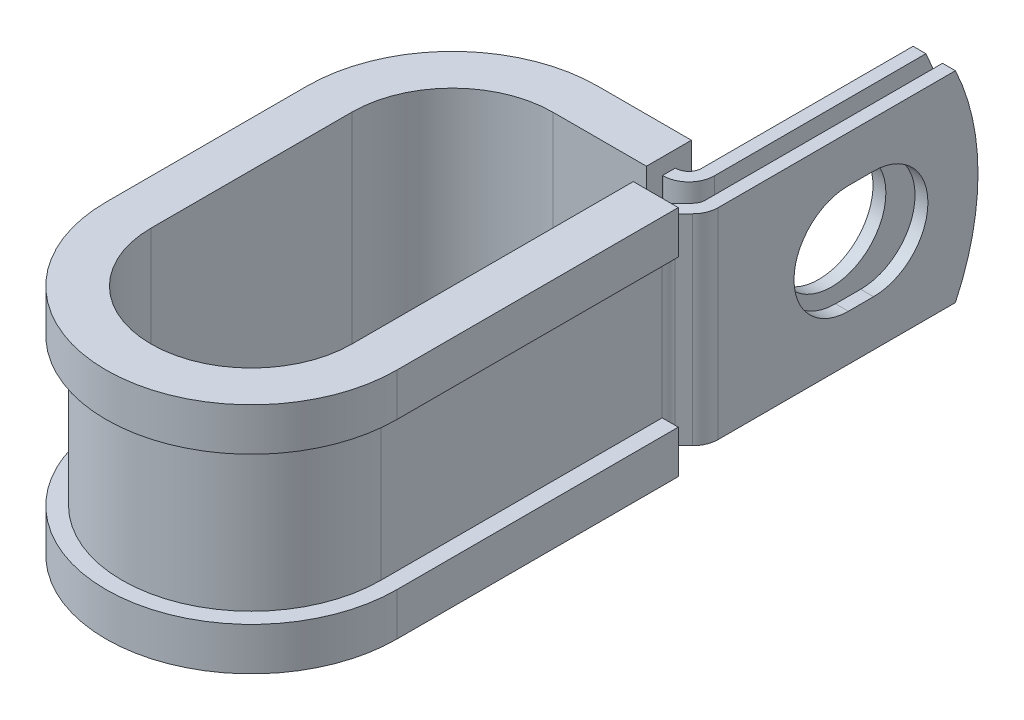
ISO-10303-21;
HEADER;
FILE_DESCRIPTION(('STEP AP214'),'2;1');
FILE_NAME('part.step','',(''),(''),'','','');
FILE_SCHEMA(('AUTOMOTIVE_DESIGN { 1 0 10303 214 1 1 1 1 }'));
ENDSEC;
DATA;
#1=APPLICATION_CONTEXT('core data for automotive mechanical design processes');
#2=APPLICATION_PROTOCOL_DEFINITION('international standard','automotive_design',2000,#1);
#3=PRODUCT_CONTEXT('',#1,'mechanical');
#4=PRODUCT('Part','Part','',(#3));
#5=PRODUCT_RELATED_PRODUCT_CATEGORY('part','',(#4));
#6=PRODUCT_DEFINITION_FORMATION('','',#4);
#7=PRODUCT_DEFINITION_CONTEXT('part definition',#1,'design');
#8=PRODUCT_DEFINITION('design','',#6,#7);
#9=PRODUCT_DEFINITION_SHAPE('','',#8);
#10=(LENGTH_UNIT() NAMED_UNIT(*) SI_UNIT(.MILLI.,.METRE.));
#11=(NAMED_UNIT(*) PLANE_ANGLE_UNIT() SI_UNIT($,.RADIAN.));
#12=(NAMED_UNIT(*) SI_UNIT($,.STERADIAN.) SOLID_ANGLE_UNIT());
#13=UNCERTAINTY_MEASURE_WITH_UNIT(LENGTH_MEASURE(1.E-05),#10,'distance_accuracy_value','');
#14=(GEOMETRIC_REPRESENTATION_CONTEXT(3) GLOBAL_UNCERTAINTY_ASSIGNED_CONTEXT((#13)) GLOBAL_UNIT_ASSIGNED_CONTEXT((#10,
#11,#12)) REPRESENTATION_CONTEXT('',''));
#15=CARTESIAN_POINT('',(0.,0.,0.));
#16=DIRECTION('',(0.,0.,1.));
#17=DIRECTION('',(1.,0.,0.));
#18=AXIS2_PLACEMENT_3D('',#15,#16,#17);
#19=CARTESIAN_POINT('',(11.7272698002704,-9.525,-11.049));
#20=DIRECTION('',(0.,1.,0.));
#21=DIRECTION('',(1.,0.,0.));
#22=AXIS2_PLACEMENT_3D('',#19,#20,#21);
#23=PLANE('',#22);
#24=DIRECTION('',(0.,0.,-1.));
#25=VECTOR('',#24,1.);
#26=CARTESIAN_POINT('',(8.8824698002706,-9.525,-11.049));
#27=LINE('',#26,#25);
#28=CARTESIAN_POINT('',(8.8824698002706,-9.525,-11.049));
#29=VERTEX_POINT('',#28);
#30=CARTESIAN_POINT('',(8.88246980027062,-9.525,-12.2682));
#31=VERTEX_POINT('',#30);
#32=EDGE_CURVE('E564',#29,#31,#27,.T.);
#33=ORIENTED_EDGE('',*,*,#32,.T.);
#34=DIRECTION('',(1.,0.,0.));
#35=VECTOR('',#34,1.);
#36=CARTESIAN_POINT('',(0.,-9.525,-12.2682));
#37=LINE('',#36,#35);
#38=CARTESIAN_POINT('',(8.93326980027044,-9.525,-12.2682));
#39=VERTEX_POINT('',#38);
#40=EDGE_CURVE('E398',#39,#31,#37,.F.);
#41=ORIENTED_EDGE('',*,*,#40,.F.);
#42=CARTESIAN_POINT('',(8.93326980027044,-9.525,-13.4874));
#43=DIRECTION('',(0.,1.,0.));
#44=DIRECTION('',(1.,0.,0.));
#45=AXIS2_PLACEMENT_3D('',#42,#43,#44);
#46=CIRCLE('',#45,1.2192);
#47=CARTESIAN_POINT('',(10.1524698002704,-9.525,-13.4874));
#48=VERTEX_POINT('',#47);
#49=EDGE_CURVE('E396',#48,#39,#46,.F.);
#50=ORIENTED_EDGE('',*,*,#49,.F.);
#51=DIRECTION('',(0.,0.,1.));
#52=VECTOR('',#51,1.);
#53=CARTESIAN_POINT('',(10.1524698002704,-9.525,-35.687));
#54=LINE('',#53,#52);
#55=CARTESIAN_POINT('',(10.1524698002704,-9.525,-33.5424631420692));
#56=VERTEX_POINT('',#55);
#57=EDGE_CURVE('E394',#56,#48,#54,.T.);
#58=ORIENTED_EDGE('',*,*,#57,.F.);
#59=DIRECTION('',(-1.,0.,0.));
#60=VECTOR('',#59,1.);
#61=CARTESIAN_POINT('',(14.1656698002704,-9.525,-33.5424631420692));
#62=LINE('',#61,#60);
#63=CARTESIAN_POINT('',(11.3716698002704,-9.525,-33.5424631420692));
#64=VERTEX_POINT('',#63);
#65=EDGE_CURVE('E12',#64,#56,#62,.T.);
#66=ORIENTED_EDGE('',*,*,#65,.F.);
#67=DIRECTION('',(0.,0.,1.));
#68=VECTOR('',#67,1.);
#69=CARTESIAN_POINT('',(11.3716698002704,-9.525,-35.687));
#70=LINE('',#69,#68);
#71=CARTESIAN_POINT('',(11.3716698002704,-9.525,-13.4874));
#72=VERTEX_POINT('',#71);
#73=EDGE_CURVE('E392',#64,#72,#70,.T.);
#74=ORIENTED_EDGE('',*,*,#73,.T.);
#75=CARTESIAN_POINT('',(8.93326980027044,-9.525,-13.4874));
#76=DIRECTION('',(0.,-1.,0.));
#77=DIRECTION('',(0.,0.,1.));
#78=AXIS2_PLACEMENT_3D('',#75,#76,#77);
#79=CIRCLE('',#78,2.4384);
#80=CARTESIAN_POINT('',(8.93326980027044,-9.525,-11.049));
#81=VERTEX_POINT('',#80);
#82=EDGE_CURVE('E389',#72,#81,#79,.T.);
#83=ORIENTED_EDGE('',*,*,#82,.T.);
#84=DIRECTION('',(-1.,0.,0.));
#85=VECTOR('',#84,1.);
#86=CARTESIAN_POINT('',(0.,-9.525,-11.049));
#87=LINE('',#86,#85);
#88=EDGE_CURVE('E386',#81,#29,#87,.T.);
#89=ORIENTED_EDGE('',*,*,#88,.T.);
#90=EDGE_LOOP('',(#33,#41,#50,#58,#66,#74,#83,#89));
#91=FACE_BOUND('',#90,.T.);
#92=ADVANCED_FACE('F37',(#91),#23,.F.);
#93=CARTESIAN_POINT('',(11.7272698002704,9.525,-11.049));
#94=DIRECTION('',(0.,1.,0.));
#95=DIRECTION('',(1.,0.,0.));
#96=AXIS2_PLACEMENT_3D('',#93,#94,#95);
#97=PLANE('',#96);
#98=DIRECTION('',(1.,0.,0.));
#99=VECTOR('',#98,1.);
#100=CARTESIAN_POINT('',(0.,9.525,-12.2682));
#101=LINE('',#100,#99);
#102=CARTESIAN_POINT('',(8.93326980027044,9.525,-12.2682));
#103=VERTEX_POINT('',#102);
#104=CARTESIAN_POINT('',(8.88246980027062,9.525,-12.2682));
#105=VERTEX_POINT('',#104);
#106=EDGE_CURVE('E359',#103,#105,#101,.F.);
#107=ORIENTED_EDGE('',*,*,#106,.T.);
#108=DIRECTION('',(0.,0.,1.));
#109=VECTOR('',#108,1.);
#110=CARTESIAN_POINT('',(8.88246980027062,9.525,-12.2682));
#111=LINE('',#110,#109);
#112=CARTESIAN_POINT('',(8.8824698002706,9.525,-11.049));
#113=VERTEX_POINT('',#112);
#114=EDGE_CURVE('E570',#105,#113,#111,.T.);
#115=ORIENTED_EDGE('',*,*,#114,.T.);
#116=DIRECTION('',(-1.,0.,0.));
#117=VECTOR('',#116,1.);
#118=CARTESIAN_POINT('',(0.,9.525,-11.049));
#119=LINE('',#118,#117);
#120=CARTESIAN_POINT('',(8.93326980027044,9.525,-11.049));
#121=VERTEX_POINT('',#120);
#122=EDGE_CURVE('E461',#121,#113,#119,.T.);
#123=ORIENTED_EDGE('',*,*,#122,.F.);
#124=CARTESIAN_POINT('',(8.93326980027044,9.525,-13.4874));
#125=DIRECTION('',(0.,-1.,0.));
#126=DIRECTION('',(0.,0.,1.));
#127=AXIS2_PLACEMENT_3D('',#124,#125,#126);
#128=CIRCLE('',#127,2.4384);
#129=CARTESIAN_POINT('',(11.3716698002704,9.525,-13.4874));
#130=VERTEX_POINT('',#129);
#131=EDGE_CURVE('E456',#130,#121,#128,.T.);
#132=ORIENTED_EDGE('',*,*,#131,.F.);
#133=DIRECTION('',(0.,0.,1.));
#134=VECTOR('',#133,1.);
#135=CARTESIAN_POINT('',(11.3716698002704,9.525,-35.687));
#136=LINE('',#135,#134);
#137=CARTESIAN_POINT('',(11.3716698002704,9.525,-33.5424631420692));
#138=VERTEX_POINT('',#137);
#139=EDGE_CURVE('E450',#138,#130,#136,.T.);
#140=ORIENTED_EDGE('',*,*,#139,.F.);
#141=DIRECTION('',(-1.,0.,0.));
#142=VECTOR('',#141,1.);
#143=CARTESIAN_POINT('',(14.1656698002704,9.525,-33.5424631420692));
#144=LINE('',#143,#142);
#145=CARTESIAN_POINT('',(10.1524698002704,9.525,-33.5424631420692));
#146=VERTEX_POINT('',#145);
#147=EDGE_CURVE('E45',#138,#146,#144,.T.);
#148=ORIENTED_EDGE('',*,*,#147,.T.);
#149=DIRECTION('',(0.,0.,1.));
#150=VECTOR('',#149,1.);
#151=CARTESIAN_POINT('',(10.1524698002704,9.525,-35.687));
#152=LINE('',#151,#150);
#153=CARTESIAN_POINT('',(10.1524698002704,9.525,-13.4874));
#154=VERTEX_POINT('',#153);
#155=EDGE_CURVE('E447',#146,#154,#152,.T.);
#156=ORIENTED_EDGE('',*,*,#155,.T.);
#157=CARTESIAN_POINT('',(8.93326980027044,9.525,-13.4874));
#158=DIRECTION('',(0.,1.,0.));
#159=DIRECTION('',(1.,0.,0.));
#160=AXIS2_PLACEMENT_3D('',#157,#158,#159);
#161=CIRCLE('',#160,1.2192);
#162=EDGE_CURVE('E364',#154,#103,#161,.F.);
#163=ORIENTED_EDGE('',*,*,#162,.T.);
#164=EDGE_LOOP('',(#107,#115,#123,#132,#140,#148,#156,#163));
#165=FACE_BOUND('',#164,.T.);
#166=ADVANCED_FACE('F446',(#165),#97,.T.);
#167=CARTESIAN_POINT('',(0.,9.525,-11.049));
#168=DIRECTION('',(0.,0.,1.));
#169=DIRECTION('',(1.,0.,0.));
#170=AXIS2_PLACEMENT_3D('',#167,#168,#169);
#171=PLANE('',#170);
#172=ORIENTED_EDGE('',*,*,#122,.T.);
#173=DIRECTION('',(0.,-1.,0.));
#174=VECTOR('',#173,1.);
#175=CARTESIAN_POINT('',(8.8824698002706,9.525,-11.049));
#176=LINE('',#175,#174);
#177=EDGE_CURVE('E567',#113,#29,#176,.T.);
#178=ORIENTED_EDGE('',*,*,#177,.T.);
#179=ORIENTED_EDGE('',*,*,#88,.F.);
#180=DIRECTION('',(0.,-1.,0.));
#181=VECTOR('',#180,1.);
#182=CARTESIAN_POINT('',(8.93326980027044,9.525,-11.049));
#183=LINE('',#182,#181);
#184=EDGE_CURVE('E434',#121,#81,#183,.T.);
#185=ORIENTED_EDGE('',*,*,#184,.F.);
#186=EDGE_LOOP('',(#172,#178,#179,#185));
#187=FACE_BOUND('',#186,.T.);
#188=ADVANCED_FACE('F771',(#187),#171,.T.);
#189=CARTESIAN_POINT('',(14.1656698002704,9.525,-11.049));
#190=DIRECTION('',(-1.,0.,0.));
#191=DIRECTION('',(0.,0.,1.));
#192=AXIS2_PLACEMENT_3D('',#189,#190,#191);
#193=PLANE('',#192);
#194=CARTESIAN_POINT('',(14.1656698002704,0.,-25.7809999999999));
#195=DIRECTION('',(1.,0.,0.));
#196=DIRECTION('',(0.,0.,-1.));
#197=AXIS2_PLACEMENT_3D('',#194,#195,#196);
#198=CIRCLE('',#197,5.1562);
#199=CARTESIAN_POINT('',(14.1656698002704,-5.1562,-25.7810000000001));
#200=VERTEX_POINT('',#199);
#201=CARTESIAN_POINT('',(14.1656698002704,5.1562,-25.7810000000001));
#202=VERTEX_POINT('',#201);
#203=EDGE_CURVE('E509',#200,#202,#198,.T.);
#204=ORIENTED_EDGE('',*,*,#203,.F.);
#205=DIRECTION('',(0.,0.,-1.));
#206=VECTOR('',#205,1.);
#207=CARTESIAN_POINT('',(14.1656698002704,-5.1562,-23.3933999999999));
#208=LINE('',#207,#206);
#209=CARTESIAN_POINT('',(14.1656698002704,-5.1562,-23.3933999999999));
#210=VERTEX_POINT('',#209);
#211=EDGE_CURVE('E506',#210,#200,#208,.T.);
#212=ORIENTED_EDGE('',*,*,#211,.F.);
#213=CARTESIAN_POINT('',(14.1656698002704,0.,-23.3933999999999));
#214=DIRECTION('',(1.,0.,0.));
#215=DIRECTION('',(0.,0.,-1.));
#216=AXIS2_PLACEMENT_3D('',#213,#214,#215);
#217=CIRCLE('',#216,5.1562);
#218=CARTESIAN_POINT('',(14.1656698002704,5.1562,-23.3933999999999));
#219=VERTEX_POINT('',#218);
#220=EDGE_CURVE('E503',#219,#210,#217,.T.);
#221=ORIENTED_EDGE('',*,*,#220,.F.);
#222=DIRECTION('',(0.,0.,1.));
#223=VECTOR('',#222,1.);
#224=CARTESIAN_POINT('',(14.1656698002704,5.1562,-23.3933999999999));
#225=LINE('',#224,#223);
#226=EDGE_CURVE('E502',#202,#219,#225,.T.);
#227=ORIENTED_EDGE('',*,*,#226,.F.);
#228=EDGE_LOOP('',(#204,#212,#221,#227));
#229=FACE_BOUND('',#228,.T.);
#230=DIRECTION('',(0.,0.,-1.));
#231=VECTOR('',#230,1.);
#232=CARTESIAN_POINT('',(14.1656698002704,-9.525,-11.049));
#233=LINE('',#232,#231);
#234=CARTESIAN_POINT('',(14.1656698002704,-9.525,-11.049));
#235=VERTEX_POINT('',#234);
#236=CARTESIAN_POINT('',(14.1656698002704,-9.525,-33.5424631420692));
#237=VERTEX_POINT('',#236);
#238=EDGE_CURVE('E370',#235,#237,#233,.T.);
#239=ORIENTED_EDGE('',*,*,#238,.T.);
#240=CARTESIAN_POINT('',(14.1656698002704,0.,-13.462));
#241=DIRECTION('',(-1.,0.,0.));
#242=DIRECTION('',(0.,0.,1.));
#243=AXIS2_PLACEMENT_3D('',#240,#241,#242);
#244=CIRCLE('',#243,22.225);
#245=CARTESIAN_POINT('',(14.1656698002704,9.525,-33.5424631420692));
#246=VERTEX_POINT('',#245);
#247=EDGE_CURVE('E518',#246,#237,#244,.T.);
#248=ORIENTED_EDGE('',*,*,#247,.F.);
#249=DIRECTION('',(0.,0.,-1.));
#250=VECTOR('',#249,1.);
#251=CARTESIAN_POINT('',(14.1656698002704,9.525,-11.049));
#252=LINE('',#251,#250);
#253=CARTESIAN_POINT('',(14.1656698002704,9.525,-11.049));
#254=VERTEX_POINT('',#253);
#255=EDGE_CURVE('E407',#254,#246,#252,.T.);
#256=ORIENTED_EDGE('',*,*,#255,.F.);
#257=DIRECTION('',(0.,-1.,0.));
#258=VECTOR('',#257,1.);
#259=CARTESIAN_POINT('',(14.1656698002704,9.525,-11.049));
#260=LINE('',#259,#258);
#261=EDGE_CURVE('E369',#254,#235,#260,.T.);
#262=ORIENTED_EDGE('',*,*,#261,.T.);
#263=EDGE_LOOP('',(#239,#248,#256,#262));
#264=FACE_BOUND('',#263,.T.);
#265=ADVANCED_FACE('F39',(#229,#264),#193,.F.);
#266=CARTESIAN_POINT('',(12.9464698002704,9.525,-11.049));
#267=DIRECTION('',(-1.,0.,0.));
#268=DIRECTION('',(0.,0.,1.));
#269=AXIS2_PLACEMENT_3D('',#266,#267,#268);
#270=PLANE('',#269);
#271=DIRECTION('',(0.,0.,-1.));
#272=VECTOR('',#271,1.);
#273=CARTESIAN_POINT('',(12.9464698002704,-5.1562,-23.3933999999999));
#274=LINE('',#273,#272);
#275=CARTESIAN_POINT('',(12.9464698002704,-5.1562,-23.3933999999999));
#276=VERTEX_POINT('',#275);
#277=CARTESIAN_POINT('',(12.9464698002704,-5.1562,-25.7810000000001));
#278=VERTEX_POINT('',#277);
#279=EDGE_CURVE('E487',#276,#278,#274,.T.);
#280=ORIENTED_EDGE('',*,*,#279,.T.);
#281=CARTESIAN_POINT('',(12.9464698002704,0.,-25.7809999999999));
#282=DIRECTION('',(-1.,0.,0.));
#283=DIRECTION('',(0.,0.,1.));
#284=AXIS2_PLACEMENT_3D('',#281,#282,#283);
#285=CIRCLE('',#284,5.1562);
#286=CARTESIAN_POINT('',(12.9464698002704,5.1562,-25.7810000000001));
#287=VERTEX_POINT('',#286);
#288=EDGE_CURVE('E486',#278,#287,#285,.F.);
#289=ORIENTED_EDGE('',*,*,#288,.T.);
#290=DIRECTION('',(0.,0.,1.));
#291=VECTOR('',#290,1.);
#292=CARTESIAN_POINT('',(12.9464698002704,5.1562,-23.3933999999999));
#293=LINE('',#292,#291);
#294=CARTESIAN_POINT('',(12.9464698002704,5.1562,-23.3933999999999));
#295=VERTEX_POINT('',#294);
#296=EDGE_CURVE('E490',#287,#295,#293,.T.);
#297=ORIENTED_EDGE('',*,*,#296,.T.);
#298=CARTESIAN_POINT('',(12.9464698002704,0.,-23.3933999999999));
#299=DIRECTION('',(-1.,0.,0.));
#300=DIRECTION('',(0.,0.,1.));
#301=AXIS2_PLACEMENT_3D('',#298,#299,#300);
#302=CIRCLE('',#301,5.1562);
#303=EDGE_CURVE('E483',#295,#276,#302,.F.);
#304=ORIENTED_EDGE('',*,*,#303,.T.);
#305=EDGE_LOOP('',(#280,#289,#297,#304));
#306=FACE_BOUND('',#305,.T.);
#307=CARTESIAN_POINT('',(12.9464698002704,0.,-13.462));
#308=DIRECTION('',(-1.,0.,0.));
#309=DIRECTION('',(0.,0.,1.));
#310=AXIS2_PLACEMENT_3D('',#307,#308,#309);
#311=CIRCLE('',#310,22.225);
#312=CARTESIAN_POINT('',(12.9464698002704,9.525,-33.5424631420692));
#313=VERTEX_POINT('',#312);
#314=CARTESIAN_POINT('',(12.9464698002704,-9.525,-33.5424631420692));
#315=VERTEX_POINT('',#314);
#316=EDGE_CURVE('E59',#313,#315,#311,.T.);
#317=ORIENTED_EDGE('',*,*,#316,.T.);
#318=DIRECTION('',(0.,0.,-1.));
#319=VECTOR('',#318,1.);
#320=CARTESIAN_POINT('',(12.9464698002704,-9.525,-11.049));
#321=LINE('',#320,#319);
#322=CARTESIAN_POINT('',(12.9464698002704,-9.525,-11.049));
#323=VERTEX_POINT('',#322);
#324=EDGE_CURVE('E373',#323,#315,#321,.T.);
#325=ORIENTED_EDGE('',*,*,#324,.F.);
#326=DIRECTION('',(0.,-1.,0.));
#327=VECTOR('',#326,1.);
#328=CARTESIAN_POINT('',(12.9464698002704,9.525,-11.049));
#329=LINE('',#328,#327);
#330=CARTESIAN_POINT('',(12.9464698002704,9.525,-11.049));
#331=VERTEX_POINT('',#330);
#332=EDGE_CURVE('E442',#331,#323,#329,.T.);
#333=ORIENTED_EDGE('',*,*,#332,.F.);
#334=DIRECTION('',(0.,0.,-1.));
#335=VECTOR('',#334,1.);
#336=CARTESIAN_POINT('',(12.9464698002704,9.525,-11.049));
#337=LINE('',#336,#335);
#338=EDGE_CURVE('E471',#331,#313,#337,.T.);
#339=ORIENTED_EDGE('',*,*,#338,.T.);
#340=EDGE_LOOP('',(#317,#325,#333,#339));
#341=FACE_BOUND('',#340,.T.);
#342=ADVANCED_FACE('F744',(#306,#341),#270,.T.);
#343=CARTESIAN_POINT('',(11.3716698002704,9.525,-35.687));
#344=DIRECTION('',(1.,0.,0.));
#345=DIRECTION('',(0.,0.,-1.));
#346=AXIS2_PLACEMENT_3D('',#343,#344,#345);
#347=PLANE('',#346);
#348=CARTESIAN_POINT('',(11.3716698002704,0.,-24.5872));
#349=DIRECTION('',(1.,0.,0.));
#350=DIRECTION('',(0.,0.,-1.));
#351=AXIS2_PLACEMENT_3D('',#348,#349,#350);
#352=CIRCLE('',#351,5.1562);
#353=CARTESIAN_POINT('',(11.3716698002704,0.,-29.7434));
#354=VERTEX_POINT('',#353);
#355=EDGE_CURVE('E374',#354,#354,#352,.F.);
#356=ORIENTED_EDGE('',*,*,#355,.T.);
#357=EDGE_LOOP('',(#356));
#358=FACE_BOUND('',#357,.T.);
#359=ORIENTED_EDGE('',*,*,#73,.F.);
#360=CARTESIAN_POINT('',(11.3716698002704,0.,-13.462));
#361=DIRECTION('',(1.,0.,0.));
#362=DIRECTION('',(0.,0.,-1.));
#363=AXIS2_PLACEMENT_3D('',#360,#361,#362);
#364=CIRCLE('',#363,22.225);
#365=EDGE_CURVE('E514',#64,#138,#364,.T.);
#366=ORIENTED_EDGE('',*,*,#365,.T.);
#367=ORIENTED_EDGE('',*,*,#139,.T.);
#368=DIRECTION('',(0.,-1.,0.));
#369=VECTOR('',#368,1.);
#370=CARTESIAN_POINT('',(11.3716698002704,9.525,-13.4874));
#371=LINE('',#370,#369);
#372=EDGE_CURVE('E431',#130,#72,#371,.T.);
#373=ORIENTED_EDGE('',*,*,#372,.T.);
#374=EDGE_LOOP('',(#359,#366,#367,#373));
#375=FACE_BOUND('',#374,.T.);
#376=ADVANCED_FACE('F779',(#358,#375),#347,.T.);
#377=CARTESIAN_POINT('',(10.1524698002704,9.525,-35.687));
#378=DIRECTION('',(1.,0.,0.));
#379=DIRECTION('',(0.,0.,-1.));
#380=AXIS2_PLACEMENT_3D('',#377,#378,#379);
#381=PLANE('',#380);
#382=CARTESIAN_POINT('',(10.1524698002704,0.,-24.5872));
#383=DIRECTION('',(-1.,0.,0.));
#384=DIRECTION('',(0.,0.,1.));
#385=AXIS2_PLACEMENT_3D('',#382,#383,#384);
#386=CIRCLE('',#385,5.1562);
#387=CARTESIAN_POINT('',(10.1524698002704,0.,-19.431));
#388=VERTEX_POINT('',#387);
#389=EDGE_CURVE('E478',#388,#388,#386,.T.);
#390=ORIENTED_EDGE('',*,*,#389,.F.);
#391=EDGE_LOOP('',(#390));
#392=FACE_BOUND('',#391,.T.);
#393=CARTESIAN_POINT('',(10.1524698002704,0.,-13.462));
#394=DIRECTION('',(-1.,0.,0.));
#395=DIRECTION('',(0.,0.,1.));
#396=AXIS2_PLACEMENT_3D('',#393,#394,#395);
#397=CIRCLE('',#396,22.225);
#398=EDGE_CURVE('E51',#146,#56,#397,.T.);
#399=ORIENTED_EDGE('',*,*,#398,.T.);
#400=ORIENTED_EDGE('',*,*,#57,.T.);
#401=DIRECTION('',(0.,-1.,0.));
#402=VECTOR('',#401,1.);
#403=CARTESIAN_POINT('',(10.1524698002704,9.525,-13.4874));
#404=LINE('',#403,#402);
#405=EDGE_CURVE('E428',#154,#48,#404,.T.);
#406=ORIENTED_EDGE('',*,*,#405,.F.);
#407=ORIENTED_EDGE('',*,*,#155,.F.);
#408=EDGE_LOOP('',(#399,#400,#406,#407));
#409=FACE_BOUND('',#408,.T.);
#410=ADVANCED_FACE('F453',(#392,#409),#381,.F.);
#411=CARTESIAN_POINT('',(13.4874,-9.525,-7.63650267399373));
#412=DIRECTION('',(0.,1.,0.));
#413=DIRECTION('',(1.,0.,0.));
#414=AXIS2_PLACEMENT_3D('',#411,#412,#413);
#415=CIRCLE('',#414,1.2192);
#416=CARTESIAN_POINT('',(12.2682,-9.525,-7.63650267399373));
#417=VERTEX_POINT('',#416);
#418=CARTESIAN_POINT('',(12.6252954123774,-9.525,-8.49860726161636));
#419=VERTEX_POINT('',#418);
#420=EDGE_CURVE('E401',#417,#419,#415,.F.);
#421=ORIENTED_EDGE('',*,*,#420,.F.);
#422=DIRECTION('',(1.,0.,0.));
#423=VECTOR('',#422,1.);
#424=CARTESIAN_POINT('',(11.049,-9.525,-7.63650267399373));
#425=LINE('',#424,#423);
#426=CARTESIAN_POINT('',(11.049,-9.525,-7.63650267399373));
#427=VERTEX_POINT('',#426);
#428=EDGE_CURVE('E352',#427,#417,#425,.T.);
#429=ORIENTED_EDGE('',*,*,#428,.F.);
#430=CARTESIAN_POINT('',(13.4874,-9.525,-7.63650267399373));
#431=DIRECTION('',(0.,-1.,0.));
#432=DIRECTION('',(0.,0.,1.));
#433=AXIS2_PLACEMENT_3D('',#430,#431,#432);
#434=CIRCLE('',#433,2.4384);
#435=CARTESIAN_POINT('',(11.7631908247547,-9.525,-9.360711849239));
#436=VERTEX_POINT('',#435);
#437=EDGE_CURVE('E383',#427,#436,#434,.T.);
#438=ORIENTED_EDGE('',*,*,#437,.T.);
#439=DIRECTION('',(0.707106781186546,0.,-0.707106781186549));
#440=VECTOR('',#439,1.);
#441=CARTESIAN_POINT('',(11.7631908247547,-9.525,-9.360711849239));
#442=LINE('',#441,#440);
#443=CARTESIAN_POINT('',(12.5893743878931,-9.525,-10.1868954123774));
#444=VERTEX_POINT('',#443);
#445=EDGE_CURVE('E380',#436,#444,#442,.T.);
#446=ORIENTED_EDGE('',*,*,#445,.T.);
#447=CARTESIAN_POINT('',(11.7272698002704,-9.525,-11.049));
#448=DIRECTION('',(0.,1.,0.));
#449=DIRECTION('',(0.,0.,1.));
#450=AXIS2_PLACEMENT_3D('',#447,#448,#449);
#451=CIRCLE('',#450,1.2192);
#452=EDGE_CURVE('E377',#444,#323,#451,.T.);
#453=ORIENTED_EDGE('',*,*,#452,.T.);
#454=ORIENTED_EDGE('',*,*,#324,.T.);
#455=DIRECTION('',(-1.,0.,0.));
#456=VECTOR('',#455,1.);
#457=CARTESIAN_POINT('',(14.1656698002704,-9.525,-33.5424631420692));
#458=LINE('',#457,#456);
#459=EDGE_CURVE('E520',#237,#315,#458,.T.);
#460=ORIENTED_EDGE('',*,*,#459,.F.);
#461=ORIENTED_EDGE('',*,*,#238,.F.);
#462=CARTESIAN_POINT('',(11.7272698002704,-9.525,-11.049));
#463=DIRECTION('',(0.,1.,0.));
#464=DIRECTION('',(1.,0.,0.));
#465=AXIS2_PLACEMENT_3D('',#462,#463,#464);
#466=CIRCLE('',#465,2.4384);
#467=CARTESIAN_POINT('',(13.4514789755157,-9.525,-9.32479082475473));
#468=VERTEX_POINT('',#467);
#469=EDGE_CURVE('E405',#468,#235,#466,.T.);
#470=ORIENTED_EDGE('',*,*,#469,.F.);
#471=DIRECTION('',(0.707106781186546,0.,-0.707106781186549));
#472=VECTOR('',#471,1.);
#473=CARTESIAN_POINT('',(12.6252954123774,-9.525,-8.49860726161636));
#474=LINE('',#473,#472);
#475=EDGE_CURVE('E403',#419,#468,#474,.T.);
#476=ORIENTED_EDGE('',*,*,#475,.F.);
#477=EDGE_LOOP('',(#421,#429,#438,#446,#453,#454,#460,#461,#470,#476));
#478=FACE_BOUND('',#477,.T.);
#479=ADVANCED_FACE('F725',(#478),#23,.F.);
#480=DIRECTION('',(-1.,0.,0.));
#481=VECTOR('',#480,1.);
#482=CARTESIAN_POINT('',(12.2682,9.525,-7.63650267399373));
#483=LINE('',#482,#481);
#484=CARTESIAN_POINT('',(12.2682,9.525,-7.63650267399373));
#485=VERTEX_POINT('',#484);
#486=CARTESIAN_POINT('',(11.049,9.525,-7.63650267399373));
#487=VERTEX_POINT('',#486);
#488=EDGE_CURVE('E332',#485,#487,#483,.T.);
#489=ORIENTED_EDGE('',*,*,#488,.F.);
#490=CARTESIAN_POINT('',(13.4874,9.525,-7.63650267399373));
#491=DIRECTION('',(0.,1.,0.));
#492=DIRECTION('',(1.,0.,0.));
#493=AXIS2_PLACEMENT_3D('',#490,#491,#492);
#494=CIRCLE('',#493,1.2192);
#495=CARTESIAN_POINT('',(12.6252954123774,9.525,-8.49860726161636));
#496=VERTEX_POINT('',#495);
#497=EDGE_CURVE('E347',#485,#496,#494,.F.);
#498=ORIENTED_EDGE('',*,*,#497,.T.);
#499=DIRECTION('',(0.707106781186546,0.,-0.707106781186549));
#500=VECTOR('',#499,1.);
#501=CARTESIAN_POINT('',(12.6252954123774,9.525,-8.49860726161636));
#502=LINE('',#501,#500);
#503=CARTESIAN_POINT('',(13.4514789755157,9.525,-9.32479082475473));
#504=VERTEX_POINT('',#503);
#505=EDGE_CURVE('E358',#496,#504,#502,.T.);
#506=ORIENTED_EDGE('',*,*,#505,.T.);
#507=CARTESIAN_POINT('',(11.7272698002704,9.525,-11.049));
#508=DIRECTION('',(0.,1.,0.));
#509=DIRECTION('',(1.,0.,0.));
#510=AXIS2_PLACEMENT_3D('',#507,#508,#509);
#511=CIRCLE('',#510,2.4384);
#512=EDGE_CURVE('E361',#504,#254,#511,.T.);
#513=ORIENTED_EDGE('',*,*,#512,.T.);
#514=ORIENTED_EDGE('',*,*,#255,.T.);
#515=DIRECTION('',(-1.,0.,0.));
#516=VECTOR('',#515,1.);
#517=CARTESIAN_POINT('',(14.1656698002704,9.525,-33.5424631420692));
#518=LINE('',#517,#516);
#519=EDGE_CURVE('E516',#246,#313,#518,.T.);
#520=ORIENTED_EDGE('',*,*,#519,.T.);
#521=ORIENTED_EDGE('',*,*,#338,.F.);
#522=CARTESIAN_POINT('',(11.7272698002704,9.525,-11.049));
#523=DIRECTION('',(0.,1.,0.));
#524=DIRECTION('',(0.,0.,1.));
#525=AXIS2_PLACEMENT_3D('',#522,#523,#524);
#526=CIRCLE('',#525,1.2192);
#527=CARTESIAN_POINT('',(12.5893743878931,9.525,-10.1868954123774));
#528=VERTEX_POINT('',#527);
#529=EDGE_CURVE('E468',#528,#331,#526,.T.);
#530=ORIENTED_EDGE('',*,*,#529,.F.);
#531=DIRECTION('',(0.707106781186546,0.,-0.707106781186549));
#532=VECTOR('',#531,1.);
#533=CARTESIAN_POINT('',(11.7631908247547,9.525,-9.360711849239));
#534=LINE('',#533,#532);
#535=CARTESIAN_POINT('',(11.7631908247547,9.525,-9.360711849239));
#536=VERTEX_POINT('',#535);
#537=EDGE_CURVE('E465',#536,#528,#534,.T.);
#538=ORIENTED_EDGE('',*,*,#537,.F.);
#539=CARTESIAN_POINT('',(13.4874,9.525,-7.63650267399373));
#540=DIRECTION('',(0.,-1.,0.));
#541=DIRECTION('',(0.,0.,1.));
#542=AXIS2_PLACEMENT_3D('',#539,#540,#541);
#543=CIRCLE('',#542,2.4384);
#544=EDGE_CURVE('E351',#487,#536,#543,.T.);
#545=ORIENTED_EDGE('',*,*,#544,.F.);
#546=EDGE_LOOP('',(#489,#498,#506,#513,#514,#520,#521,#530,#538,#545));
#547=FACE_BOUND('',#546,.T.);
#548=ADVANCED_FACE('F346',(#547),#97,.T.);
#549=CARTESIAN_POINT('',(11.7272698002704,9.525,-11.049));
#550=DIRECTION('',(0.,-1.,0.));
#551=DIRECTION('',(0.,0.,-1.));
#552=AXIS2_PLACEMENT_3D('',#549,#550,#551);
#553=CYLINDRICAL_SURFACE('',#552,1.2192);
#554=ORIENTED_EDGE('',*,*,#452,.F.);
#555=DIRECTION('',(0.,-1.,0.));
#556=VECTOR('',#555,1.);
#557=CARTESIAN_POINT('',(12.5893743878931,9.525,-10.1868954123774));
#558=LINE('',#557,#556);
#559=EDGE_CURVE('E440',#528,#444,#558,.T.);
#560=ORIENTED_EDGE('',*,*,#559,.F.);
#561=ORIENTED_EDGE('',*,*,#529,.T.);
#562=ORIENTED_EDGE('',*,*,#332,.T.);
#563=EDGE_LOOP('',(#554,#560,#561,#562));
#564=FACE_BOUND('',#563,.T.);
#565=ADVANCED_FACE('F747',(#564),#553,.F.);
#566=CARTESIAN_POINT('',(11.7631908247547,9.525,-9.360711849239));
#567=DIRECTION('',(-0.707106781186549,0.,-0.707106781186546));
#568=DIRECTION('',(-0.707106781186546,0.,0.707106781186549));
#569=AXIS2_PLACEMENT_3D('',#566,#567,#568);
#570=PLANE('',#569);
#571=ORIENTED_EDGE('',*,*,#445,.F.);
#572=DIRECTION('',(0.,-1.,0.));
#573=VECTOR('',#572,1.);
#574=CARTESIAN_POINT('',(11.7631908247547,9.525,-9.360711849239));
#575=LINE('',#574,#573);
#576=EDGE_CURVE('E438',#536,#436,#575,.T.);
#577=ORIENTED_EDGE('',*,*,#576,.F.);
#578=ORIENTED_EDGE('',*,*,#537,.T.);
#579=ORIENTED_EDGE('',*,*,#559,.T.);
#580=EDGE_LOOP('',(#571,#577,#578,#579));
#581=FACE_BOUND('',#580,.T.);
#582=ADVANCED_FACE('F750',(#581),#570,.T.);
#583=CARTESIAN_POINT('',(13.4874,9.525,-7.63650267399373));
#584=DIRECTION('',(0.,-1.,0.));
#585=DIRECTION('',(0.,0.,-1.));
#586=AXIS2_PLACEMENT_3D('',#583,#584,#585);
#587=CYLINDRICAL_SURFACE('',#586,2.4384);
#588=ORIENTED_EDGE('',*,*,#437,.F.);
#589=DIRECTION('',(0.,-1.,0.));
#590=VECTOR('',#589,1.);
#591=CARTESIAN_POINT('',(11.049,9.525,-7.63650267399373));
#592=LINE('',#591,#590);
#593=EDGE_CURVE('E436',#487,#427,#592,.T.);
#594=ORIENTED_EDGE('',*,*,#593,.F.);
#595=ORIENTED_EDGE('',*,*,#544,.T.);
#596=ORIENTED_EDGE('',*,*,#576,.T.);
#597=EDGE_LOOP('',(#588,#594,#595,#596));
#598=FACE_BOUND('',#597,.T.);
#599=ADVANCED_FACE('F752',(#598),#587,.T.);
#600=CARTESIAN_POINT('',(8.93326980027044,9.525,-13.4874));
#601=DIRECTION('',(0.,-1.,0.));
#602=DIRECTION('',(0.,0.,-1.));
#603=AXIS2_PLACEMENT_3D('',#600,#601,#602);
#604=CYLINDRICAL_SURFACE('',#603,2.4384);
#605=ORIENTED_EDGE('',*,*,#82,.F.);
#606=ORIENTED_EDGE('',*,*,#372,.F.);
#607=ORIENTED_EDGE('',*,*,#131,.T.);
#608=ORIENTED_EDGE('',*,*,#184,.T.);
#609=EDGE_LOOP('',(#605,#606,#607,#608));
#610=FACE_BOUND('',#609,.T.);
#611=ADVANCED_FACE('F754',(#610),#604,.T.);
#612=CARTESIAN_POINT('',(8.93326980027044,9.525,-13.4874));
#613=DIRECTION('',(0.,-1.,0.));
#614=DIRECTION('',(0.,0.,-1.));
#615=AXIS2_PLACEMENT_3D('',#612,#613,#614);
#616=CYLINDRICAL_SURFACE('',#615,1.2192);
#617=ORIENTED_EDGE('',*,*,#49,.T.);
#618=DIRECTION('',(0.,-1.,0.));
#619=VECTOR('',#618,1.);
#620=CARTESIAN_POINT('',(8.93326980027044,9.525,-12.2682));
#621=LINE('',#620,#619);
#622=EDGE_CURVE('E425',#103,#39,#621,.T.);
#623=ORIENTED_EDGE('',*,*,#622,.F.);
#624=ORIENTED_EDGE('',*,*,#162,.F.);
#625=ORIENTED_EDGE('',*,*,#405,.T.);
#626=EDGE_LOOP('',(#617,#623,#624,#625));
#627=FACE_BOUND('',#626,.T.);
#628=ADVANCED_FACE('F760',(#627),#616,.F.);
#629=CARTESIAN_POINT('',(0.,9.525,-12.2682));
#630=DIRECTION('',(0.,0.,1.));
#631=DIRECTION('',(1.,0.,0.));
#632=AXIS2_PLACEMENT_3D('',#629,#630,#631);
#633=PLANE('',#632);
#634=DIRECTION('',(0.,-1.,0.));
#635=VECTOR('',#634,1.);
#636=CARTESIAN_POINT('',(0.,9.525,-12.2682));
#637=LINE('',#636,#635);
#638=CARTESIAN_POINT('',(1.75445224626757E-13,6.985,-12.2682));
#639=VERTEX_POINT('',#638);
#640=CARTESIAN_POINT('',(1.75445224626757E-13,-6.985,-12.2682));
#641=VERTEX_POINT('',#640);
#642=EDGE_CURVE('E422',#639,#641,#637,.T.);
#643=ORIENTED_EDGE('',*,*,#642,.F.);
#644=DIRECTION('',(1.,0.,0.));
#645=VECTOR('',#644,1.);
#646=CARTESIAN_POINT('',(1.75445224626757E-13,6.985,-12.2682));
#647=LINE('',#646,#645);
#648=CARTESIAN_POINT('',(8.88246980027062,6.985,-12.2682));
#649=VERTEX_POINT('',#648);
#650=EDGE_CURVE('E523',#639,#649,#647,.T.);
#651=ORIENTED_EDGE('',*,*,#650,.T.);
#652=DIRECTION('',(0.,1.,0.));
#653=VECTOR('',#652,1.);
#654=CARTESIAN_POINT('',(8.88246980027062,9.525,-12.2682));
#655=LINE('',#654,#653);
#656=EDGE_CURVE('E573',#649,#105,#655,.T.);
#657=ORIENTED_EDGE('',*,*,#656,.T.);
#658=ORIENTED_EDGE('',*,*,#106,.F.);
#659=ORIENTED_EDGE('',*,*,#622,.T.);
#660=ORIENTED_EDGE('',*,*,#40,.T.);
#661=DIRECTION('',(0.,1.,0.));
#662=VECTOR('',#661,1.);
#663=CARTESIAN_POINT('',(8.88246980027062,-9.525,-12.2682));
#664=LINE('',#663,#662);
#665=CARTESIAN_POINT('',(8.88246980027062,-6.985,-12.2682));
#666=VERTEX_POINT('',#665);
#667=EDGE_CURVE('E561',#31,#666,#664,.T.);
#668=ORIENTED_EDGE('',*,*,#667,.T.);
#669=DIRECTION('',(1.,0.,0.));
#670=VECTOR('',#669,1.);
#671=CARTESIAN_POINT('',(1.75445224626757E-13,-6.985,-12.2682));
#672=LINE('',#671,#670);
#673=EDGE_CURVE('E544',#641,#666,#672,.T.);
#674=ORIENTED_EDGE('',*,*,#673,.F.);
#675=EDGE_LOOP('',(#643,#651,#657,#658,#659,#660,#668,#674));
#676=FACE_BOUND('',#675,.T.);
#677=ADVANCED_FACE('F812',(#676),#633,.F.);
#678=CARTESIAN_POINT('',(0.,9.525,0.));
#679=DIRECTION('',(0.,-1.,0.));
#680=DIRECTION('',(0.,0.,-1.));
#681=AXIS2_PLACEMENT_3D('',#678,#679,#680);
#682=CYLINDRICAL_SURFACE('',#681,12.2682);
#683=DIRECTION('',(0.,-1.,0.));
#684=VECTOR('',#683,1.);
#685=CARTESIAN_POINT('',(-12.2682,9.525,0.));
#686=LINE('',#685,#684);
#687=CARTESIAN_POINT('',(-12.2682,6.985,-1.73472347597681E-13));
#688=VERTEX_POINT('',#687);
#689=CARTESIAN_POINT('',(-12.2682,-6.985,-1.73472347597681E-13));
#690=VERTEX_POINT('',#689);
#691=EDGE_CURVE('E419',#688,#690,#686,.T.);
#692=ORIENTED_EDGE('',*,*,#691,.F.);
#693=CARTESIAN_POINT('',(0.,6.985,0.));
#694=DIRECTION('',(0.,-1.,0.));
#695=DIRECTION('',(0.,0.,-1.));
#696=AXIS2_PLACEMENT_3D('',#693,#694,#695);
#697=CIRCLE('',#696,12.2682);
#698=EDGE_CURVE('E576',#688,#639,#697,.T.);
#699=ORIENTED_EDGE('',*,*,#698,.T.);
#700=ORIENTED_EDGE('',*,*,#642,.T.);
#701=CARTESIAN_POINT('',(0.,-6.985,0.));
#702=DIRECTION('',(0.,-1.,0.));
#703=DIRECTION('',(0.,0.,-1.));
#704=AXIS2_PLACEMENT_3D('',#701,#702,#703);
#705=CIRCLE('',#704,12.2682);
#706=EDGE_CURVE('E597',#690,#641,#705,.T.);
#707=ORIENTED_EDGE('',*,*,#706,.F.);
#708=EDGE_LOOP('',(#692,#699,#700,#707));
#709=FACE_BOUND('',#708,.T.);
#710=ADVANCED_FACE('F823',(#709),#682,.T.);
#711=CARTESIAN_POINT('',(-12.2682,9.525,0.));
#712=DIRECTION('',(1.,0.,0.));
#713=DIRECTION('',(0.,0.,-1.));
#714=AXIS2_PLACEMENT_3D('',#711,#712,#713);
#715=PLANE('',#714);
#716=DIRECTION('',(0.,-1.,0.));
#717=VECTOR('',#716,1.);
#718=CARTESIAN_POINT('',(-12.2682,9.525,19.05));
#719=LINE('',#718,#717);
#720=CARTESIAN_POINT('',(-12.2682,6.985,19.0499999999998));
#721=VERTEX_POINT('',#720);
#722=CARTESIAN_POINT('',(-12.2682,-6.985,19.0499999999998));
#723=VERTEX_POINT('',#722);
#724=EDGE_CURVE('E416',#721,#723,#719,.T.);
#725=ORIENTED_EDGE('',*,*,#724,.F.);
#726=DIRECTION('',(0.,0.,-1.));
#727=VECTOR('',#726,1.);
#728=CARTESIAN_POINT('',(-12.2682,6.985,19.0499999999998));
#729=LINE('',#728,#727);
#730=EDGE_CURVE('E608',#721,#688,#729,.T.);
#731=ORIENTED_EDGE('',*,*,#730,.T.);
#732=ORIENTED_EDGE('',*,*,#691,.T.);
#733=DIRECTION('',(0.,0.,-1.));
#734=VECTOR('',#733,1.);
#735=CARTESIAN_POINT('',(-12.2682,-6.985,19.0499999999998));
#736=LINE('',#735,#734);
#737=EDGE_CURVE('E629',#723,#690,#736,.T.);
#738=ORIENTED_EDGE('',*,*,#737,.F.);
#739=EDGE_LOOP('',(#725,#731,#732,#738));
#740=FACE_BOUND('',#739,.T.);
#741=ADVANCED_FACE('F828',(#740),#715,.F.);
#742=CARTESIAN_POINT('',(0.,9.525,19.05));
#743=DIRECTION('',(0.,-1.,0.));
#744=DIRECTION('',(0.,0.,-1.));
#745=AXIS2_PLACEMENT_3D('',#742,#743,#744);
#746=CYLINDRICAL_SURFACE('',#745,12.2682);
#747=DIRECTION('',(0.,-1.,0.));
#748=VECTOR('',#747,1.);
#749=CARTESIAN_POINT('',(12.2682,9.525,19.05));
#750=LINE('',#749,#748);
#751=CARTESIAN_POINT('',(12.2682,6.985,19.05));
#752=VERTEX_POINT('',#751);
#753=CARTESIAN_POINT('',(12.2682,-6.985,19.05));
#754=VERTEX_POINT('',#753);
#755=EDGE_CURVE('E341',#752,#754,#750,.T.);
#756=ORIENTED_EDGE('',*,*,#755,.F.);
#757=CARTESIAN_POINT('',(0.,6.985,19.05));
#758=DIRECTION('',(0.,-1.,0.));
#759=DIRECTION('',(0.,0.,-1.));
#760=AXIS2_PLACEMENT_3D('',#757,#758,#759);
#761=CIRCLE('',#760,12.2682);
#762=EDGE_CURVE('E640',#752,#721,#761,.T.);
#763=ORIENTED_EDGE('',*,*,#762,.T.);
#764=ORIENTED_EDGE('',*,*,#724,.T.);
#765=CARTESIAN_POINT('',(0.,-6.985,19.05));
#766=DIRECTION('',(0.,-1.,0.));
#767=DIRECTION('',(0.,0.,-1.));
#768=AXIS2_PLACEMENT_3D('',#765,#766,#767);
#769=CIRCLE('',#768,12.2682);
#770=EDGE_CURVE('E661',#754,#723,#769,.T.);
#771=ORIENTED_EDGE('',*,*,#770,.F.);
#772=EDGE_LOOP('',(#756,#763,#764,#771));
#773=FACE_BOUND('',#772,.T.);
#774=ADVANCED_FACE('F833',(#773),#746,.T.);
#775=CARTESIAN_POINT('',(12.2682,9.525,0.));
#776=DIRECTION('',(-1.,0.,0.));
#777=DIRECTION('',(0.,0.,1.));
#778=AXIS2_PLACEMENT_3D('',#775,#776,#777);
#779=PLANE('',#778);
#780=DIRECTION('',(0.,-1.,0.));
#781=VECTOR('',#780,1.);
#782=CARTESIAN_POINT('',(12.2682,9.525,-7.63650267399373));
#783=LINE('',#782,#781);
#784=CARTESIAN_POINT('',(12.2682,6.985,-7.63650267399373));
#785=VERTEX_POINT('',#784);
#786=CARTESIAN_POINT('',(12.2682,-6.985,-7.63650267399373));
#787=VERTEX_POINT('',#786);
#788=EDGE_CURVE('E342',#785,#787,#783,.T.);
#789=ORIENTED_EDGE('',*,*,#788,.F.);
#790=DIRECTION('',(0.,0.,-1.));
#791=VECTOR('',#790,1.);
#792=CARTESIAN_POINT('',(12.2682,6.985,0.));
#793=LINE('',#792,#791);
#794=EDGE_CURVE('E681',#752,#785,#793,.T.);
#795=ORIENTED_EDGE('',*,*,#794,.F.);
#796=ORIENTED_EDGE('',*,*,#755,.T.);
#797=DIRECTION('',(0.,0.,-1.));
#798=VECTOR('',#797,1.);
#799=CARTESIAN_POINT('',(12.2682,-6.985,0.));
#800=LINE('',#799,#798);
#801=EDGE_CURVE('E682',#754,#787,#800,.T.);
#802=ORIENTED_EDGE('',*,*,#801,.T.);
#803=EDGE_LOOP('',(#789,#795,#796,#802));
#804=FACE_BOUND('',#803,.T.);
#805=ADVANCED_FACE('F836',(#804),#779,.F.);
#806=CARTESIAN_POINT('',(13.4874,9.525,-7.63650267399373));
#807=DIRECTION('',(0.,-1.,0.));
#808=DIRECTION('',(0.,0.,-1.));
#809=AXIS2_PLACEMENT_3D('',#806,#807,#808);
#810=CYLINDRICAL_SURFACE('',#809,1.2192);
#811=ORIENTED_EDGE('',*,*,#420,.T.);
#812=DIRECTION('',(0.,-1.,0.));
#813=VECTOR('',#812,1.);
#814=CARTESIAN_POINT('',(12.6252954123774,9.525,-8.49860726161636));
#815=LINE('',#814,#813);
#816=EDGE_CURVE('E356',#496,#419,#815,.T.);
#817=ORIENTED_EDGE('',*,*,#816,.F.);
#818=ORIENTED_EDGE('',*,*,#497,.F.);
#819=EDGE_CURVE('E329',#485,#785,#783,.T.);
#820=ORIENTED_EDGE('',*,*,#819,.T.);
#821=ORIENTED_EDGE('',*,*,#788,.T.);
#822=DIRECTION('',(0.,1.,0.));
#823=VECTOR('',#822,1.);
#824=CARTESIAN_POINT('',(12.2682,-9.525,-7.63650267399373));
#825=LINE('',#824,#823);
#826=EDGE_CURVE('E716',#417,#787,#825,.T.);
#827=ORIENTED_EDGE('',*,*,#826,.F.);
#828=EDGE_LOOP('',(#811,#817,#818,#820,#821,#827));
#829=FACE_BOUND('',#828,.T.);
#830=ADVANCED_FACE('F354',(#829),#810,.F.);
#831=CARTESIAN_POINT('',(12.6252954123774,9.525,-8.49860726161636));
#832=DIRECTION('',(-0.707106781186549,0.,-0.707106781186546));
#833=DIRECTION('',(-0.707106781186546,0.,0.707106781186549));
#834=AXIS2_PLACEMENT_3D('',#831,#832,#833);
#835=PLANE('',#834);
#836=ORIENTED_EDGE('',*,*,#475,.T.);
#837=DIRECTION('',(0.,-1.,0.));
#838=VECTOR('',#837,1.);
#839=CARTESIAN_POINT('',(13.4514789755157,9.525,-9.32479082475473));
#840=LINE('',#839,#838);
#841=EDGE_CURVE('E410',#504,#468,#840,.T.);
#842=ORIENTED_EDGE('',*,*,#841,.F.);
#843=ORIENTED_EDGE('',*,*,#505,.F.);
#844=ORIENTED_EDGE('',*,*,#816,.T.);
#845=EDGE_LOOP('',(#836,#842,#843,#844));
#846=FACE_BOUND('',#845,.T.);
#847=ADVANCED_FACE('F730',(#846),#835,.F.);
#848=CARTESIAN_POINT('',(11.7272698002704,9.525,-11.049));
#849=DIRECTION('',(0.,-1.,0.));
#850=DIRECTION('',(0.,0.,-1.));
#851=AXIS2_PLACEMENT_3D('',#848,#849,#850);
#852=CYLINDRICAL_SURFACE('',#851,2.4384);
#853=ORIENTED_EDGE('',*,*,#469,.T.);
#854=ORIENTED_EDGE('',*,*,#261,.F.);
#855=ORIENTED_EDGE('',*,*,#512,.F.);
#856=ORIENTED_EDGE('',*,*,#841,.T.);
#857=EDGE_LOOP('',(#853,#854,#855,#856));
#858=FACE_BOUND('',#857,.T.);
#859=ADVANCED_FACE('F733',(#858),#852,.T.);
#860=CARTESIAN_POINT('',(25.9556057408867,0.,-24.5872));
#861=DIRECTION('',(-1.,0.,0.));
#862=DIRECTION('',(0.,0.,1.));
#863=AXIS2_PLACEMENT_3D('',#860,#861,#862);
#864=CYLINDRICAL_SURFACE('',#863,5.1562);
#865=ORIENTED_EDGE('',*,*,#389,.T.);
#866=EDGE_LOOP('',(#865));
#867=FACE_BOUND('',#866,.T.);
#868=ORIENTED_EDGE('',*,*,#355,.F.);
#869=EDGE_LOOP('',(#868));
#870=FACE_BOUND('',#869,.T.);
#871=ADVANCED_FACE('F947',(#867,#870),#864,.F.);
#872=CARTESIAN_POINT('',(-3.41310213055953,-5.1562,-23.3933999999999));
#873=DIRECTION('',(0.,-1.,0.));
#874=DIRECTION('',(0.,0.,-1.));
#875=AXIS2_PLACEMENT_3D('',#872,#873,#874);
#876=PLANE('',#875);
#877=DIRECTION('',(1.,0.,0.));
#878=VECTOR('',#877,1.);
#879=CARTESIAN_POINT('',(-3.41310213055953,-5.1562,-23.3933999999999));
#880=LINE('',#879,#878);
#881=EDGE_CURVE('E481',#276,#210,#880,.T.);
#882=ORIENTED_EDGE('',*,*,#881,.T.);
#883=ORIENTED_EDGE('',*,*,#211,.T.);
#884=DIRECTION('',(1.,0.,0.));
#885=VECTOR('',#884,1.);
#886=CARTESIAN_POINT('',(-3.41310213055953,-5.1562,-25.7810000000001));
#887=LINE('',#886,#885);
#888=EDGE_CURVE('E484',#278,#200,#887,.T.);
#889=ORIENTED_EDGE('',*,*,#888,.F.);
#890=ORIENTED_EDGE('',*,*,#279,.F.);
#891=EDGE_LOOP('',(#882,#883,#889,#890));
#892=FACE_BOUND('',#891,.T.);
#893=ADVANCED_FACE('F943',(#892),#876,.F.);
#894=CARTESIAN_POINT('',(-3.41310213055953,0.,-25.7809999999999));
#895=DIRECTION('',(1.,0.,0.));
#896=DIRECTION('',(0.,0.,-1.));
#897=AXIS2_PLACEMENT_3D('',#894,#895,#896);
#898=CYLINDRICAL_SURFACE('',#897,5.1562);
#899=ORIENTED_EDGE('',*,*,#888,.T.);
#900=ORIENTED_EDGE('',*,*,#203,.T.);
#901=DIRECTION('',(1.,0.,0.));
#902=VECTOR('',#901,1.);
#903=CARTESIAN_POINT('',(-3.41310213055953,5.1562,-25.7810000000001));
#904=LINE('',#903,#902);
#905=EDGE_CURVE('E488',#287,#202,#904,.T.);
#906=ORIENTED_EDGE('',*,*,#905,.F.);
#907=ORIENTED_EDGE('',*,*,#288,.F.);
#908=EDGE_LOOP('',(#899,#900,#906,#907));
#909=FACE_BOUND('',#908,.T.);
#910=ADVANCED_FACE('F939',(#909),#898,.F.);
#911=CARTESIAN_POINT('',(-3.41310213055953,5.1562,-23.3933999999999));
#912=DIRECTION('',(0.,1.,0.));
#913=DIRECTION('',(0.,0.,1.));
#914=AXIS2_PLACEMENT_3D('',#911,#912,#913);
#915=PLANE('',#914);
#916=ORIENTED_EDGE('',*,*,#905,.T.);
#917=ORIENTED_EDGE('',*,*,#226,.T.);
#918=DIRECTION('',(1.,0.,0.));
#919=VECTOR('',#918,1.);
#920=CARTESIAN_POINT('',(-3.41310213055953,5.1562,-23.3933999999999));
#921=LINE('',#920,#919);
#922=EDGE_CURVE('E491',#295,#219,#921,.T.);
#923=ORIENTED_EDGE('',*,*,#922,.F.);
#924=ORIENTED_EDGE('',*,*,#296,.F.);
#925=EDGE_LOOP('',(#916,#917,#923,#924));
#926=FACE_BOUND('',#925,.T.);
#927=ADVANCED_FACE('F935',(#926),#915,.F.);
#928=CARTESIAN_POINT('',(-3.41310213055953,0.,-23.3933999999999));
#929=DIRECTION('',(1.,0.,0.));
#930=DIRECTION('',(0.,0.,-1.));
#931=AXIS2_PLACEMENT_3D('',#928,#929,#930);
#932=CYLINDRICAL_SURFACE('',#931,5.1562);
#933=ORIENTED_EDGE('',*,*,#922,.T.);
#934=ORIENTED_EDGE('',*,*,#220,.T.);
#935=ORIENTED_EDGE('',*,*,#881,.F.);
#936=ORIENTED_EDGE('',*,*,#303,.F.);
#937=EDGE_LOOP('',(#933,#934,#935,#936));
#938=FACE_BOUND('',#937,.T.);
#939=ADVANCED_FACE('F932',(#938),#932,.F.);
#940=CARTESIAN_POINT('',(14.1656698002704,0.,-13.462));
#941=DIRECTION('',(-1.,0.,0.));
#942=DIRECTION('',(0.,0.,1.));
#943=AXIS2_PLACEMENT_3D('',#940,#941,#942);
#944=CYLINDRICAL_SURFACE('',#943,22.225);
#945=ORIENTED_EDGE('',*,*,#365,.F.);
#946=ORIENTED_EDGE('',*,*,#65,.T.);
#947=ORIENTED_EDGE('',*,*,#398,.F.);
#948=ORIENTED_EDGE('',*,*,#147,.F.);
#949=EDGE_LOOP('',(#945,#946,#947,#948));
#950=FACE_BOUND('',#949,.T.);
#951=ADVANCED_FACE('F803',(#950),#944,.T.);
#952=ORIENTED_EDGE('',*,*,#519,.F.);
#953=ORIENTED_EDGE('',*,*,#247,.T.);
#954=ORIENTED_EDGE('',*,*,#459,.T.);
#955=ORIENTED_EDGE('',*,*,#316,.F.);
#956=EDGE_LOOP('',(#952,#953,#954,#955));
#957=FACE_BOUND('',#956,.T.);
#958=ADVANCED_FACE('F740',(#957),#944,.T.);
#959=CARTESIAN_POINT('',(1.99976431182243E-13,11.049,-13.7922));
#960=DIRECTION('',(0.,0.,1.));
#961=DIRECTION('',(1.,0.,0.));
#962=AXIS2_PLACEMENT_3D('',#959,#960,#961);
#963=PLANE('',#962);
#964=DIRECTION('',(0.,-1.,0.));
#965=VECTOR('',#964,1.);
#966=CARTESIAN_POINT('',(1.99976431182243E-13,11.049,-13.7922));
#967=LINE('',#966,#965);
#968=CARTESIAN_POINT('',(1.99976431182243E-13,11.049,-13.7922));
#969=VERTEX_POINT('',#968);
#970=CARTESIAN_POINT('',(1.99976431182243E-13,6.985,-13.7922));
#971=VERTEX_POINT('',#970);
#972=EDGE_CURVE('E599',#969,#971,#967,.T.);
#973=ORIENTED_EDGE('',*,*,#972,.F.);
#974=DIRECTION('',(1.,0.,0.));
#975=VECTOR('',#974,1.);
#976=CARTESIAN_POINT('',(1.99976431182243E-13,11.049,-13.7922));
#977=LINE('',#976,#975);
#978=CARTESIAN_POINT('',(8.88246980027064,11.049,-13.7922));
#979=VERTEX_POINT('',#978);
#980=EDGE_CURVE('E529',#969,#979,#977,.T.);
#981=ORIENTED_EDGE('',*,*,#980,.T.);
#982=DIRECTION('',(0.,-1.,0.));
#983=VECTOR('',#982,1.);
#984=CARTESIAN_POINT('',(8.88246980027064,11.049,-13.7922));
#985=LINE('',#984,#983);
#986=CARTESIAN_POINT('',(8.88246980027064,6.985,-13.7922));
#987=VERTEX_POINT('',#986);
#988=EDGE_CURVE('E549',#979,#987,#985,.T.);
#989=ORIENTED_EDGE('',*,*,#988,.T.);
#990=DIRECTION('',(1.,0.,0.));
#991=VECTOR('',#990,1.);
#992=CARTESIAN_POINT('',(1.99976431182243E-13,6.985,-13.7922));
#993=LINE('',#992,#991);
#994=EDGE_CURVE('E526',#971,#987,#993,.T.);
#995=ORIENTED_EDGE('',*,*,#994,.F.);
#996=EDGE_LOOP('',(#973,#981,#989,#995));
#997=FACE_BOUND('',#996,.T.);
#998=ADVANCED_FACE('F872',(#997),#963,.F.);
#999=CARTESIAN_POINT('',(1.36840167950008E-13,11.049,-9.525));
#1000=DIRECTION('',(0.,0.,-1.));
#1001=DIRECTION('',(-1.,0.,0.));
#1002=AXIS2_PLACEMENT_3D('',#999,#1000,#1001);
#1003=PLANE('',#1002);
#1004=DIRECTION('',(0.,1.,0.));
#1005=VECTOR('',#1004,1.);
#1006=CARTESIAN_POINT('',(1.36840167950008E-13,11.049,-9.525));
#1007=LINE('',#1006,#1005);
#1008=CARTESIAN_POINT('',(1.36840167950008E-13,-11.049,-9.525));
#1009=VERTEX_POINT('',#1008);
#1010=CARTESIAN_POINT('',(1.36840167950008E-13,11.049,-9.525));
#1011=VERTEX_POINT('',#1010);
#1012=EDGE_CURVE('E602',#1009,#1011,#1007,.T.);
#1013=ORIENTED_EDGE('',*,*,#1012,.F.);
#1014=DIRECTION('',(1.,0.,0.));
#1015=VECTOR('',#1014,1.);
#1016=CARTESIAN_POINT('',(1.36840167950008E-13,-11.049,-9.525));
#1017=LINE('',#1016,#1015);
#1018=CARTESIAN_POINT('',(8.88246980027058,-11.049,-9.525));
#1019=VERTEX_POINT('',#1018);
#1020=EDGE_CURVE('E535',#1009,#1019,#1017,.T.);
#1021=ORIENTED_EDGE('',*,*,#1020,.T.);
#1022=DIRECTION('',(0.,1.,0.));
#1023=VECTOR('',#1022,1.);
#1024=CARTESIAN_POINT('',(8.88246980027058,11.049,-9.525));
#1025=LINE('',#1024,#1023);
#1026=CARTESIAN_POINT('',(8.88246980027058,11.049,-9.525));
#1027=VERTEX_POINT('',#1026);
#1028=EDGE_CURVE('E553',#1019,#1027,#1025,.T.);
#1029=ORIENTED_EDGE('',*,*,#1028,.T.);
#1030=DIRECTION('',(1.,0.,0.));
#1031=VECTOR('',#1030,1.);
#1032=CARTESIAN_POINT('',(1.36840167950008E-13,11.049,-9.525));
#1033=LINE('',#1032,#1031);
#1034=EDGE_CURVE('E532',#1011,#1027,#1033,.T.);
#1035=ORIENTED_EDGE('',*,*,#1034,.F.);
#1036=EDGE_LOOP('',(#1013,#1021,#1029,#1035));
#1037=FACE_BOUND('',#1036,.T.);
#1038=ADVANCED_FACE('F878',(#1037),#1003,.F.);
#1039=CARTESIAN_POINT('',(1.99976431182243E-13,-11.049,-13.7922));
#1040=DIRECTION('',(0.,0.,1.));
#1041=DIRECTION('',(1.,0.,0.));
#1042=AXIS2_PLACEMENT_3D('',#1039,#1040,#1041);
#1043=PLANE('',#1042);
#1044=DIRECTION('',(0.,-1.,0.));
#1045=VECTOR('',#1044,1.);
#1046=CARTESIAN_POINT('',(1.99976431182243E-13,-11.049,-13.7922));
#1047=LINE('',#1046,#1045);
#1048=CARTESIAN_POINT('',(1.99976431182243E-13,-6.985,-13.7922));
#1049=VERTEX_POINT('',#1048);
#1050=CARTESIAN_POINT('',(1.99976431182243E-13,-11.049,-13.7922));
#1051=VERTEX_POINT('',#1050);
#1052=EDGE_CURVE('E605',#1049,#1051,#1047,.T.);
#1053=ORIENTED_EDGE('',*,*,#1052,.F.);
#1054=DIRECTION('',(1.,0.,0.));
#1055=VECTOR('',#1054,1.);
#1056=CARTESIAN_POINT('',(1.99976431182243E-13,-6.985,-13.7922));
#1057=LINE('',#1056,#1055);
#1058=CARTESIAN_POINT('',(8.88246980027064,-6.985,-13.7922));
#1059=VERTEX_POINT('',#1058);
#1060=EDGE_CURVE('E541',#1049,#1059,#1057,.T.);
#1061=ORIENTED_EDGE('',*,*,#1060,.T.);
#1062=DIRECTION('',(0.,-1.,0.));
#1063=VECTOR('',#1062,1.);
#1064=CARTESIAN_POINT('',(8.88246980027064,-11.049,-13.7922));
#1065=LINE('',#1064,#1063);
#1066=CARTESIAN_POINT('',(8.88246980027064,-11.049,-13.7922));
#1067=VERTEX_POINT('',#1066);
#1068=EDGE_CURVE('E557',#1059,#1067,#1065,.T.);
#1069=ORIENTED_EDGE('',*,*,#1068,.T.);
#1070=DIRECTION('',(1.,0.,0.));
#1071=VECTOR('',#1070,1.);
#1072=CARTESIAN_POINT('',(1.99976431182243E-13,-11.049,-13.7922));
#1073=LINE('',#1072,#1071);
#1074=EDGE_CURVE('E538',#1051,#1067,#1073,.T.);
#1075=ORIENTED_EDGE('',*,*,#1074,.F.);
#1076=EDGE_LOOP('',(#1053,#1061,#1069,#1075));
#1077=FACE_BOUND('',#1076,.T.);
#1078=ADVANCED_FACE('F886',(#1077),#1043,.F.);
#1079=CARTESIAN_POINT('',(0.,9.525,0.));
#1080=DIRECTION('',(0.,-1.,0.));
#1081=DIRECTION('',(0.,0.,-1.));
#1082=AXIS2_PLACEMENT_3D('',#1079,#1080,#1081);
#1083=CYLINDRICAL_SURFACE('',#1082,13.7922);
#1084=DIRECTION('',(0.,-1.,0.));
#1085=VECTOR('',#1084,1.);
#1086=CARTESIAN_POINT('',(-13.7922,11.049,-1.97758476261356E-13));
#1087=LINE('',#1086,#1085);
#1088=CARTESIAN_POINT('',(-13.7922,11.049,-1.97758476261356E-13));
#1089=VERTEX_POINT('',#1088);
#1090=CARTESIAN_POINT('',(-13.7922,6.985,-1.97758476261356E-13));
#1091=VERTEX_POINT('',#1090);
#1092=EDGE_CURVE('E631',#1089,#1091,#1087,.T.);
#1093=ORIENTED_EDGE('',*,*,#1092,.F.);
#1094=CARTESIAN_POINT('',(0.,11.049,0.));
#1095=DIRECTION('',(0.,-1.,0.));
#1096=DIRECTION('',(0.,0.,-1.));
#1097=AXIS2_PLACEMENT_3D('',#1094,#1095,#1096);
#1098=CIRCLE('',#1097,13.7922);
#1099=EDGE_CURVE('E582',#1089,#969,#1098,.T.);
#1100=ORIENTED_EDGE('',*,*,#1099,.T.);
#1101=ORIENTED_EDGE('',*,*,#972,.T.);
#1102=CARTESIAN_POINT('',(0.,6.985,0.));
#1103=DIRECTION('',(0.,-1.,0.));
#1104=DIRECTION('',(0.,0.,-1.));
#1105=AXIS2_PLACEMENT_3D('',#1102,#1103,#1104);
#1106=CIRCLE('',#1105,13.7922);
#1107=EDGE_CURVE('E579',#1091,#971,#1106,.T.);
#1108=ORIENTED_EDGE('',*,*,#1107,.F.);
#1109=EDGE_LOOP('',(#1093,#1100,#1101,#1108));
#1110=FACE_BOUND('',#1109,.T.);
#1111=ADVANCED_FACE('F869',(#1110),#1083,.T.);
#1112=CARTESIAN_POINT('',(0.,9.525,0.));
#1113=DIRECTION('',(0.,-1.,0.));
#1114=DIRECTION('',(0.,0.,-1.));
#1115=AXIS2_PLACEMENT_3D('',#1112,#1113,#1114);
#1116=CYLINDRICAL_SURFACE('',#1115,9.525);
#1117=DIRECTION('',(0.,1.,0.));
#1118=VECTOR('',#1117,1.);
#1119=CARTESIAN_POINT('',(-9.525,11.049,-1.35308431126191E-13));
#1120=LINE('',#1119,#1118);
#1121=CARTESIAN_POINT('',(-9.525,-11.049,-1.35308431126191E-13));
#1122=VERTEX_POINT('',#1121);
#1123=CARTESIAN_POINT('',(-9.525,11.049,-1.35308431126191E-13));
#1124=VERTEX_POINT('',#1123);
#1125=EDGE_CURVE('E634',#1122,#1124,#1120,.T.);
#1126=ORIENTED_EDGE('',*,*,#1125,.F.);
#1127=CARTESIAN_POINT('',(0.,-11.049,0.));
#1128=DIRECTION('',(0.,-1.,0.));
#1129=DIRECTION('',(0.,0.,-1.));
#1130=AXIS2_PLACEMENT_3D('',#1127,#1128,#1129);
#1131=CIRCLE('',#1130,9.525);
#1132=EDGE_CURVE('E588',#1122,#1009,#1131,.T.);
#1133=ORIENTED_EDGE('',*,*,#1132,.T.);
#1134=ORIENTED_EDGE('',*,*,#1012,.T.);
#1135=CARTESIAN_POINT('',(0.,11.049,0.));
#1136=DIRECTION('',(0.,-1.,0.));
#1137=DIRECTION('',(0.,0.,-1.));
#1138=AXIS2_PLACEMENT_3D('',#1135,#1136,#1137);
#1139=CIRCLE('',#1138,9.525);
#1140=EDGE_CURVE('E585',#1124,#1011,#1139,.T.);
#1141=ORIENTED_EDGE('',*,*,#1140,.F.);
#1142=EDGE_LOOP('',(#1126,#1133,#1134,#1141));
#1143=FACE_BOUND('',#1142,.T.);
#1144=ADVANCED_FACE('F881',(#1143),#1116,.F.);
#1145=CARTESIAN_POINT('',(0.,9.525,0.));
#1146=DIRECTION('',(0.,-1.,0.));
#1147=DIRECTION('',(0.,0.,-1.));
#1148=AXIS2_PLACEMENT_3D('',#1145,#1146,#1147);
#1149=CYLINDRICAL_SURFACE('',#1148,13.7922);
#1150=DIRECTION('',(0.,-1.,0.));
#1151=VECTOR('',#1150,1.);
#1152=CARTESIAN_POINT('',(-13.7922,-11.049,-1.97758476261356E-13));
#1153=LINE('',#1152,#1151);
#1154=CARTESIAN_POINT('',(-13.7922,-6.985,-1.97758476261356E-13));
#1155=VERTEX_POINT('',#1154);
#1156=CARTESIAN_POINT('',(-13.7922,-11.049,-1.97758476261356E-13));
#1157=VERTEX_POINT('',#1156);
#1158=EDGE_CURVE('E637',#1155,#1157,#1153,.T.);
#1159=ORIENTED_EDGE('',*,*,#1158,.F.);
#1160=CARTESIAN_POINT('',(0.,-6.985,0.));
#1161=DIRECTION('',(0.,-1.,0.));
#1162=DIRECTION('',(0.,0.,-1.));
#1163=AXIS2_PLACEMENT_3D('',#1160,#1161,#1162);
#1164=CIRCLE('',#1163,13.7922);
#1165=EDGE_CURVE('E594',#1155,#1049,#1164,.T.);
#1166=ORIENTED_EDGE('',*,*,#1165,.T.);
#1167=ORIENTED_EDGE('',*,*,#1052,.T.);
#1168=CARTESIAN_POINT('',(0.,-11.049,0.));
#1169=DIRECTION('',(0.,-1.,0.));
#1170=DIRECTION('',(0.,0.,-1.));
#1171=AXIS2_PLACEMENT_3D('',#1168,#1169,#1170);
#1172=CIRCLE('',#1171,13.7922);
#1173=EDGE_CURVE('E591',#1157,#1051,#1172,.T.);
#1174=ORIENTED_EDGE('',*,*,#1173,.F.);
#1175=EDGE_LOOP('',(#1159,#1166,#1167,#1174));
#1176=FACE_BOUND('',#1175,.T.);
#1177=ADVANCED_FACE('F890',(#1176),#1149,.T.);
#1178=CARTESIAN_POINT('',(-13.7922,11.049,19.0499999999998));
#1179=DIRECTION('',(1.,0.,0.));
#1180=DIRECTION('',(0.,0.,-1.));
#1181=AXIS2_PLACEMENT_3D('',#1178,#1179,#1180);
#1182=PLANE('',#1181);
#1183=DIRECTION('',(0.,-1.,0.));
#1184=VECTOR('',#1183,1.);
#1185=CARTESIAN_POINT('',(-13.7922,11.049,19.0499999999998));
#1186=LINE('',#1185,#1184);
#1187=CARTESIAN_POINT('',(-13.7922,11.049,19.0499999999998));
#1188=VERTEX_POINT('',#1187);
#1189=CARTESIAN_POINT('',(-13.7922,6.985,19.0499999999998));
#1190=VERTEX_POINT('',#1189);
#1191=EDGE_CURVE('E663',#1188,#1190,#1186,.T.);
#1192=ORIENTED_EDGE('',*,*,#1191,.F.);
#1193=DIRECTION('',(0.,0.,-1.));
#1194=VECTOR('',#1193,1.);
#1195=CARTESIAN_POINT('',(-13.7922,11.049,19.0499999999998));
#1196=LINE('',#1195,#1194);
#1197=EDGE_CURVE('E614',#1188,#1089,#1196,.T.);
#1198=ORIENTED_EDGE('',*,*,#1197,.T.);
#1199=ORIENTED_EDGE('',*,*,#1092,.T.);
#1200=DIRECTION('',(0.,0.,-1.));
#1201=VECTOR('',#1200,1.);
#1202=CARTESIAN_POINT('',(-13.7922,6.985,19.0499999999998));
#1203=LINE('',#1202,#1201);
#1204=EDGE_CURVE('E611',#1190,#1091,#1203,.T.);
#1205=ORIENTED_EDGE('',*,*,#1204,.F.);
#1206=EDGE_LOOP('',(#1192,#1198,#1199,#1205));
#1207=FACE_BOUND('',#1206,.T.);
#1208=ADVANCED_FACE('F866',(#1207),#1182,.F.);
#1209=CARTESIAN_POINT('',(-9.525,11.049,19.0499999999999));
#1210=DIRECTION('',(-1.,0.,0.));
#1211=DIRECTION('',(0.,-1.,0.));
#1212=AXIS2_PLACEMENT_3D('',#1209,#1210,#1211);
#1213=PLANE('',#1212);
#1214=DIRECTION('',(0.,1.,0.));
#1215=VECTOR('',#1214,1.);
#1216=CARTESIAN_POINT('',(-9.525,11.049,19.0499999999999));
#1217=LINE('',#1216,#1215);
#1218=CARTESIAN_POINT('',(-9.525,-11.049,19.0499999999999));
#1219=VERTEX_POINT('',#1218);
#1220=CARTESIAN_POINT('',(-9.525,11.049,19.0499999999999));
#1221=VERTEX_POINT('',#1220);
#1222=EDGE_CURVE('E666',#1219,#1221,#1217,.T.);
#1223=ORIENTED_EDGE('',*,*,#1222,.F.);
#1224=DIRECTION('',(0.,0.,-1.));
#1225=VECTOR('',#1224,1.);
#1226=CARTESIAN_POINT('',(-9.525,-11.049,19.0499999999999));
#1227=LINE('',#1226,#1225);
#1228=EDGE_CURVE('E620',#1219,#1122,#1227,.T.);
#1229=ORIENTED_EDGE('',*,*,#1228,.T.);
#1230=ORIENTED_EDGE('',*,*,#1125,.T.);
#1231=DIRECTION('',(0.,0.,-1.));
#1232=VECTOR('',#1231,1.);
#1233=CARTESIAN_POINT('',(-9.525,11.049,19.0499999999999));
#1234=LINE('',#1233,#1232);
#1235=EDGE_CURVE('E617',#1221,#1124,#1234,.T.);
#1236=ORIENTED_EDGE('',*,*,#1235,.F.);
#1237=EDGE_LOOP('',(#1223,#1229,#1230,#1236));
#1238=FACE_BOUND('',#1237,.T.);
#1239=ADVANCED_FACE('F912',(#1238),#1213,.F.);
#1240=CARTESIAN_POINT('',(-13.7922,-11.049,19.0499999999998));
#1241=DIRECTION('',(1.,0.,0.));
#1242=DIRECTION('',(0.,0.,-1.));
#1243=AXIS2_PLACEMENT_3D('',#1240,#1241,#1242);
#1244=PLANE('',#1243);
#1245=DIRECTION('',(0.,-1.,0.));
#1246=VECTOR('',#1245,1.);
#1247=CARTESIAN_POINT('',(-13.7922,-11.049,19.0499999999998));
#1248=LINE('',#1247,#1246);
#1249=CARTESIAN_POINT('',(-13.7922,-6.985,19.0499999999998));
#1250=VERTEX_POINT('',#1249);
#1251=CARTESIAN_POINT('',(-13.7922,-11.049,19.0499999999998));
#1252=VERTEX_POINT('',#1251);
#1253=EDGE_CURVE('E669',#1250,#1252,#1248,.T.);
#1254=ORIENTED_EDGE('',*,*,#1253,.F.);
#1255=DIRECTION('',(0.,0.,-1.));
#1256=VECTOR('',#1255,1.);
#1257=CARTESIAN_POINT('',(-13.7922,-6.985,19.0499999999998));
#1258=LINE('',#1257,#1256);
#1259=EDGE_CURVE('E626',#1250,#1155,#1258,.T.);
#1260=ORIENTED_EDGE('',*,*,#1259,.T.);
#1261=ORIENTED_EDGE('',*,*,#1158,.T.);
#1262=DIRECTION('',(0.,0.,-1.));
#1263=VECTOR('',#1262,1.);
#1264=CARTESIAN_POINT('',(-13.7922,-11.049,19.0499999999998));
#1265=LINE('',#1264,#1263);
#1266=EDGE_CURVE('E623',#1252,#1157,#1265,.T.);
#1267=ORIENTED_EDGE('',*,*,#1266,.F.);
#1268=EDGE_LOOP('',(#1254,#1260,#1261,#1267));
#1269=FACE_BOUND('',#1268,.T.);
#1270=ADVANCED_FACE('F892',(#1269),#1244,.F.);
#1271=CARTESIAN_POINT('',(0.,9.525,19.05));
#1272=DIRECTION('',(0.,-1.,0.));
#1273=DIRECTION('',(0.,0.,-1.));
#1274=AXIS2_PLACEMENT_3D('',#1271,#1272,#1273);
#1275=CYLINDRICAL_SURFACE('',#1274,13.7922);
#1276=DIRECTION('',(0.,-1.,0.));
#1277=VECTOR('',#1276,1.);
#1278=CARTESIAN_POINT('',(13.7922,11.049,19.05));
#1279=LINE('',#1278,#1277);
#1280=CARTESIAN_POINT('',(13.7922,11.049,19.05));
#1281=VERTEX_POINT('',#1280);
#1282=CARTESIAN_POINT('',(13.7922,6.985,19.05));
#1283=VERTEX_POINT('',#1282);
#1284=EDGE_CURVE('E672',#1281,#1283,#1279,.T.);
#1285=ORIENTED_EDGE('',*,*,#1284,.F.);
#1286=CARTESIAN_POINT('',(0.,11.049,19.05));
#1287=DIRECTION('',(0.,-1.,0.));
#1288=DIRECTION('',(0.,0.,-1.));
#1289=AXIS2_PLACEMENT_3D('',#1286,#1287,#1288);
#1290=CIRCLE('',#1289,13.7922);
#1291=EDGE_CURVE('E646',#1281,#1188,#1290,.T.);
#1292=ORIENTED_EDGE('',*,*,#1291,.T.);
#1293=ORIENTED_EDGE('',*,*,#1191,.T.);
#1294=CARTESIAN_POINT('',(0.,6.985,19.05));
#1295=DIRECTION('',(0.,-1.,0.));
#1296=DIRECTION('',(0.,0.,-1.));
#1297=AXIS2_PLACEMENT_3D('',#1294,#1295,#1296);
#1298=CIRCLE('',#1297,13.7922);
#1299=EDGE_CURVE('E643',#1283,#1190,#1298,.T.);
#1300=ORIENTED_EDGE('',*,*,#1299,.F.);
#1301=EDGE_LOOP('',(#1285,#1292,#1293,#1300));
#1302=FACE_BOUND('',#1301,.T.);
#1303=ADVANCED_FACE('F863',(#1302),#1275,.T.);
#1304=CARTESIAN_POINT('',(0.,9.525,19.05));
#1305=DIRECTION('',(0.,-1.,0.));
#1306=DIRECTION('',(0.,0.,-1.));
#1307=AXIS2_PLACEMENT_3D('',#1304,#1305,#1306);
#1308=CYLINDRICAL_SURFACE('',#1307,9.525);
#1309=DIRECTION('',(0.,1.,0.));
#1310=VECTOR('',#1309,1.);
#1311=CARTESIAN_POINT('',(9.525,11.049,19.05));
#1312=LINE('',#1311,#1310);
#1313=CARTESIAN_POINT('',(9.525,-11.049,19.05));
#1314=VERTEX_POINT('',#1313);
#1315=CARTESIAN_POINT('',(9.525,11.049,19.05));
#1316=VERTEX_POINT('',#1315);
#1317=EDGE_CURVE('E675',#1314,#1316,#1312,.T.);
#1318=ORIENTED_EDGE('',*,*,#1317,.F.);
#1319=CARTESIAN_POINT('',(0.,-11.049,19.05));
#1320=DIRECTION('',(0.,-1.,0.));
#1321=DIRECTION('',(0.,0.,-1.));
#1322=AXIS2_PLACEMENT_3D('',#1319,#1320,#1321);
#1323=CIRCLE('',#1322,9.525);
#1324=EDGE_CURVE('E652',#1314,#1219,#1323,.T.);
#1325=ORIENTED_EDGE('',*,*,#1324,.T.);
#1326=ORIENTED_EDGE('',*,*,#1222,.T.);
#1327=CARTESIAN_POINT('',(0.,11.049,19.05));
#1328=DIRECTION('',(0.,-1.,0.));
#1329=DIRECTION('',(0.,0.,-1.));
#1330=AXIS2_PLACEMENT_3D('',#1327,#1328,#1329);
#1331=CIRCLE('',#1330,9.525);
#1332=EDGE_CURVE('E649',#1316,#1221,#1331,.T.);
#1333=ORIENTED_EDGE('',*,*,#1332,.F.);
#1334=EDGE_LOOP('',(#1318,#1325,#1326,#1333));
#1335=FACE_BOUND('',#1334,.T.);
#1336=ADVANCED_FACE('F896',(#1335),#1308,.F.);
#1337=CARTESIAN_POINT('',(0.,9.525,19.05));
#1338=DIRECTION('',(0.,-1.,0.));
#1339=DIRECTION('',(0.,0.,-1.));
#1340=AXIS2_PLACEMENT_3D('',#1337,#1338,#1339);
#1341=CYLINDRICAL_SURFACE('',#1340,13.7922);
#1342=DIRECTION('',(0.,-1.,0.));
#1343=VECTOR('',#1342,1.);
#1344=CARTESIAN_POINT('',(13.7922,-11.049,19.05));
#1345=LINE('',#1344,#1343);
#1346=CARTESIAN_POINT('',(13.7922,-6.985,19.05));
#1347=VERTEX_POINT('',#1346);
#1348=CARTESIAN_POINT('',(13.7922,-11.049,19.05));
#1349=VERTEX_POINT('',#1348);
#1350=EDGE_CURVE('E678',#1347,#1349,#1345,.T.);
#1351=ORIENTED_EDGE('',*,*,#1350,.F.);
#1352=CARTESIAN_POINT('',(0.,-6.985,19.05));
#1353=DIRECTION('',(0.,-1.,0.));
#1354=DIRECTION('',(0.,0.,-1.));
#1355=AXIS2_PLACEMENT_3D('',#1352,#1353,#1354);
#1356=CIRCLE('',#1355,13.7922);
#1357=EDGE_CURVE('E658',#1347,#1250,#1356,.T.);
#1358=ORIENTED_EDGE('',*,*,#1357,.T.);
#1359=ORIENTED_EDGE('',*,*,#1253,.T.);
#1360=CARTESIAN_POINT('',(0.,-11.049,19.05));
#1361=DIRECTION('',(0.,-1.,0.));
#1362=DIRECTION('',(0.,0.,-1.));
#1363=AXIS2_PLACEMENT_3D('',#1360,#1361,#1362);
#1364=CIRCLE('',#1363,13.7922);
#1365=EDGE_CURVE('E655',#1349,#1252,#1364,.T.);
#1366=ORIENTED_EDGE('',*,*,#1365,.F.);
#1367=EDGE_LOOP('',(#1351,#1358,#1359,#1366));
#1368=FACE_BOUND('',#1367,.T.);
#1369=ADVANCED_FACE('F894',(#1368),#1341,.T.);
#1370=CARTESIAN_POINT('',(13.7922,6.985,0.));
#1371=DIRECTION('',(0.,-1.,0.));
#1372=DIRECTION('',(0.,0.,-1.));
#1373=AXIS2_PLACEMENT_3D('',#1370,#1371,#1372);
#1374=PLANE('',#1373);
#1375=DIRECTION('',(-1.,0.,0.));
#1376=VECTOR('',#1375,1.);
#1377=CARTESIAN_POINT('',(13.7922,6.985,-7.63650267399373));
#1378=LINE('',#1377,#1376);
#1379=CARTESIAN_POINT('',(13.7922,6.985,-7.63650267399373));
#1380=VERTEX_POINT('',#1379);
#1381=EDGE_CURVE('E336',#1380,#785,#1378,.T.);
#1382=ORIENTED_EDGE('',*,*,#1381,.F.);
#1383=DIRECTION('',(0.,0.,-1.));
#1384=VECTOR('',#1383,1.);
#1385=CARTESIAN_POINT('',(13.7922,6.985,0.));
#1386=LINE('',#1385,#1384);
#1387=EDGE_CURVE('E695',#1283,#1380,#1386,.T.);
#1388=ORIENTED_EDGE('',*,*,#1387,.F.);
#1389=ORIENTED_EDGE('',*,*,#1299,.T.);
#1390=ORIENTED_EDGE('',*,*,#1204,.T.);
#1391=ORIENTED_EDGE('',*,*,#1107,.T.);
#1392=ORIENTED_EDGE('',*,*,#994,.T.);
#1393=DIRECTION('',(0.,0.,1.));
#1394=VECTOR('',#1393,1.);
#1395=CARTESIAN_POINT('',(8.88246980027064,6.985,-13.7922));
#1396=LINE('',#1395,#1394);
#1397=EDGE_CURVE('E547',#987,#649,#1396,.T.);
#1398=ORIENTED_EDGE('',*,*,#1397,.T.);
#1399=ORIENTED_EDGE('',*,*,#650,.F.);
#1400=ORIENTED_EDGE('',*,*,#698,.F.);
#1401=ORIENTED_EDGE('',*,*,#730,.F.);
#1402=ORIENTED_EDGE('',*,*,#762,.F.);
#1403=ORIENTED_EDGE('',*,*,#794,.T.);
#1404=EDGE_LOOP('',(#1382,#1388,#1389,#1390,#1391,#1392,#1398,#1399,#1400,#1401,#1402,#1403));
#1405=FACE_BOUND('',#1404,.T.);
#1406=ADVANCED_FACE('F825',(#1405),#1374,.T.);
#1407=CARTESIAN_POINT('',(13.7922,11.049,0.));
#1408=DIRECTION('',(1.,0.,0.));
#1409=DIRECTION('',(0.,0.,-1.));
#1410=AXIS2_PLACEMENT_3D('',#1407,#1408,#1409);
#1411=PLANE('',#1410);
#1412=DIRECTION('',(0.,-1.,0.));
#1413=VECTOR('',#1412,1.);
#1414=CARTESIAN_POINT('',(13.7922,11.049,-7.63650267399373));
#1415=LINE('',#1414,#1413);
#1416=CARTESIAN_POINT('',(13.7922,11.049,-7.63650267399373));
#1417=VERTEX_POINT('',#1416);
#1418=EDGE_CURVE('E699',#1417,#1380,#1415,.T.);
#1419=ORIENTED_EDGE('',*,*,#1418,.F.);
#1420=DIRECTION('',(0.,0.,-1.));
#1421=VECTOR('',#1420,1.);
#1422=CARTESIAN_POINT('',(13.7922,11.049,0.));
#1423=LINE('',#1422,#1421);
#1424=EDGE_CURVE('E693',#1281,#1417,#1423,.T.);
#1425=ORIENTED_EDGE('',*,*,#1424,.F.);
#1426=ORIENTED_EDGE('',*,*,#1284,.T.);
#1427=ORIENTED_EDGE('',*,*,#1387,.T.);
#1428=EDGE_LOOP('',(#1419,#1425,#1426,#1427));
#1429=FACE_BOUND('',#1428,.T.);
#1430=ADVANCED_FACE('F860',(#1429),#1411,.T.);
#1431=CARTESIAN_POINT('',(13.7922,11.049,0.));
#1432=DIRECTION('',(0.,1.,0.));
#1433=DIRECTION('',(0.,0.,1.));
#1434=AXIS2_PLACEMENT_3D('',#1431,#1432,#1433);
#1435=PLANE('',#1434);
#1436=DIRECTION('',(1.,0.,0.));
#1437=VECTOR('',#1436,1.);
#1438=CARTESIAN_POINT('',(13.7922,11.049,-7.63650267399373));
#1439=LINE('',#1438,#1437);
#1440=CARTESIAN_POINT('',(9.525,11.049,-7.63650267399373));
#1441=VERTEX_POINT('',#1440);
#1442=EDGE_CURVE('E701',#1441,#1417,#1439,.T.);
#1443=ORIENTED_EDGE('',*,*,#1442,.F.);
#1444=DIRECTION('',(0.,0.,-1.));
#1445=VECTOR('',#1444,1.);
#1446=CARTESIAN_POINT('',(9.525,11.049,0.));
#1447=LINE('',#1446,#1445);
#1448=EDGE_CURVE('E691',#1316,#1441,#1447,.T.);
#1449=ORIENTED_EDGE('',*,*,#1448,.F.);
#1450=ORIENTED_EDGE('',*,*,#1332,.T.);
#1451=ORIENTED_EDGE('',*,*,#1235,.T.);
#1452=ORIENTED_EDGE('',*,*,#1140,.T.);
#1453=ORIENTED_EDGE('',*,*,#1034,.T.);
#1454=DIRECTION('',(0.,0.,-1.));
#1455=VECTOR('',#1454,1.);
#1456=CARTESIAN_POINT('',(8.88246980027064,11.049,-13.7922));
#1457=LINE('',#1456,#1455);
#1458=EDGE_CURVE('E551',#1027,#979,#1457,.T.);
#1459=ORIENTED_EDGE('',*,*,#1458,.T.);
#1460=ORIENTED_EDGE('',*,*,#980,.F.);
#1461=ORIENTED_EDGE('',*,*,#1099,.F.);
#1462=ORIENTED_EDGE('',*,*,#1197,.F.);
#1463=ORIENTED_EDGE('',*,*,#1291,.F.);
#1464=ORIENTED_EDGE('',*,*,#1424,.T.);
#1465=EDGE_LOOP('',(#1443,#1449,#1450,#1451,#1452,#1453,#1459,#1460,#1461,#1462,#1463,#1464));
#1466=FACE_BOUND('',#1465,.T.);
#1467=ADVANCED_FACE('F855',(#1466),#1435,.T.);
#1468=CARTESIAN_POINT('',(9.525,11.049,0.));
#1469=DIRECTION('',(-1.,0.,0.));
#1470=DIRECTION('',(0.,0.,1.));
#1471=AXIS2_PLACEMENT_3D('',#1468,#1469,#1470);
#1472=PLANE('',#1471);
#1473=DIRECTION('',(0.,1.,0.));
#1474=VECTOR('',#1473,1.);
#1475=CARTESIAN_POINT('',(9.525,11.049,-7.63650267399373));
#1476=LINE('',#1475,#1474);
#1477=CARTESIAN_POINT('',(9.525,-11.049,-7.63650267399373));
#1478=VERTEX_POINT('',#1477);
#1479=EDGE_CURVE('E704',#1478,#1441,#1476,.T.);
#1480=ORIENTED_EDGE('',*,*,#1479,.F.);
#1481=DIRECTION('',(0.,0.,-1.));
#1482=VECTOR('',#1481,1.);
#1483=CARTESIAN_POINT('',(9.525,-11.049,0.));
#1484=LINE('',#1483,#1482);
#1485=EDGE_CURVE('E689',#1314,#1478,#1484,.T.);
#1486=ORIENTED_EDGE('',*,*,#1485,.F.);
#1487=ORIENTED_EDGE('',*,*,#1317,.T.);
#1488=ORIENTED_EDGE('',*,*,#1448,.T.);
#1489=EDGE_LOOP('',(#1480,#1486,#1487,#1488));
#1490=FACE_BOUND('',#1489,.T.);
#1491=ADVANCED_FACE('F851',(#1490),#1472,.T.);
#1492=CARTESIAN_POINT('',(9.525,-11.049,0.));
#1493=DIRECTION('',(0.,-1.,0.));
#1494=DIRECTION('',(0.,0.,-1.));
#1495=AXIS2_PLACEMENT_3D('',#1492,#1493,#1494);
#1496=PLANE('',#1495);
#1497=DIRECTION('',(-1.,0.,0.));
#1498=VECTOR('',#1497,1.);
#1499=CARTESIAN_POINT('',(9.525,-11.049,-7.63650267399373));
#1500=LINE('',#1499,#1498);
#1501=CARTESIAN_POINT('',(13.7922,-11.049,-7.63650267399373));
#1502=VERTEX_POINT('',#1501);
#1503=EDGE_CURVE('E707',#1502,#1478,#1500,.T.);
#1504=ORIENTED_EDGE('',*,*,#1503,.F.);
#1505=DIRECTION('',(0.,0.,-1.));
#1506=VECTOR('',#1505,1.);
#1507=CARTESIAN_POINT('',(13.7922,-11.049,0.));
#1508=LINE('',#1507,#1506);
#1509=EDGE_CURVE('E687',#1349,#1502,#1508,.T.);
#1510=ORIENTED_EDGE('',*,*,#1509,.F.);
#1511=ORIENTED_EDGE('',*,*,#1365,.T.);
#1512=ORIENTED_EDGE('',*,*,#1266,.T.);
#1513=ORIENTED_EDGE('',*,*,#1173,.T.);
#1514=ORIENTED_EDGE('',*,*,#1074,.T.);
#1515=DIRECTION('',(0.,0.,1.));
#1516=VECTOR('',#1515,1.);
#1517=CARTESIAN_POINT('',(8.88246980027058,-11.049,-9.525));
#1518=LINE('',#1517,#1516);
#1519=EDGE_CURVE('E555',#1067,#1019,#1518,.T.);
#1520=ORIENTED_EDGE('',*,*,#1519,.T.);
#1521=ORIENTED_EDGE('',*,*,#1020,.F.);
#1522=ORIENTED_EDGE('',*,*,#1132,.F.);
#1523=ORIENTED_EDGE('',*,*,#1228,.F.);
#1524=ORIENTED_EDGE('',*,*,#1324,.F.);
#1525=ORIENTED_EDGE('',*,*,#1485,.T.);
#1526=EDGE_LOOP('',(#1504,#1510,#1511,#1512,#1513,#1514,#1520,#1521,#1522,#1523,#1524,#1525));
#1527=FACE_BOUND('',#1526,.T.);
#1528=ADVANCED_FACE('F846',(#1527),#1496,.T.);
#1529=CARTESIAN_POINT('',(13.7922,-11.049,0.));
#1530=DIRECTION('',(1.,0.,0.));
#1531=DIRECTION('',(0.,0.,-1.));
#1532=AXIS2_PLACEMENT_3D('',#1529,#1530,#1531);
#1533=PLANE('',#1532);
#1534=DIRECTION('',(0.,-1.,0.));
#1535=VECTOR('',#1534,1.);
#1536=CARTESIAN_POINT('',(13.7922,-11.049,-7.63650267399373));
#1537=LINE('',#1536,#1535);
#1538=CARTESIAN_POINT('',(13.7922,-6.985,-7.63650267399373));
#1539=VERTEX_POINT('',#1538);
#1540=EDGE_CURVE('E710',#1539,#1502,#1537,.T.);
#1541=ORIENTED_EDGE('',*,*,#1540,.F.);
#1542=DIRECTION('',(0.,0.,-1.));
#1543=VECTOR('',#1542,1.);
#1544=CARTESIAN_POINT('',(13.7922,-6.985,0.));
#1545=LINE('',#1544,#1543);
#1546=EDGE_CURVE('E685',#1347,#1539,#1545,.T.);
#1547=ORIENTED_EDGE('',*,*,#1546,.F.);
#1548=ORIENTED_EDGE('',*,*,#1350,.T.);
#1549=ORIENTED_EDGE('',*,*,#1509,.T.);
#1550=EDGE_LOOP('',(#1541,#1547,#1548,#1549));
#1551=FACE_BOUND('',#1550,.T.);
#1552=ADVANCED_FACE('F842',(#1551),#1533,.T.);
#1553=CARTESIAN_POINT('',(12.2682,-6.985,0.));
#1554=DIRECTION('',(0.,1.,0.));
#1555=DIRECTION('',(0.,0.,1.));
#1556=AXIS2_PLACEMENT_3D('',#1553,#1554,#1555);
#1557=PLANE('',#1556);
#1558=DIRECTION('',(1.,0.,0.));
#1559=VECTOR('',#1558,1.);
#1560=CARTESIAN_POINT('',(12.2682,-6.985,-7.63650267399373));
#1561=LINE('',#1560,#1559);
#1562=EDGE_CURVE('E713',#787,#1539,#1561,.T.);
#1563=ORIENTED_EDGE('',*,*,#1562,.F.);
#1564=ORIENTED_EDGE('',*,*,#801,.F.);
#1565=ORIENTED_EDGE('',*,*,#770,.T.);
#1566=ORIENTED_EDGE('',*,*,#737,.T.);
#1567=ORIENTED_EDGE('',*,*,#706,.T.);
#1568=ORIENTED_EDGE('',*,*,#673,.T.);
#1569=DIRECTION('',(0.,0.,-1.));
#1570=VECTOR('',#1569,1.);
#1571=CARTESIAN_POINT('',(8.88246980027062,-6.985,-12.2682));
#1572=LINE('',#1571,#1570);
#1573=EDGE_CURVE('E559',#666,#1059,#1572,.T.);
#1574=ORIENTED_EDGE('',*,*,#1573,.T.);
#1575=ORIENTED_EDGE('',*,*,#1060,.F.);
#1576=ORIENTED_EDGE('',*,*,#1165,.F.);
#1577=ORIENTED_EDGE('',*,*,#1259,.F.);
#1578=ORIENTED_EDGE('',*,*,#1357,.F.);
#1579=ORIENTED_EDGE('',*,*,#1546,.T.);
#1580=EDGE_LOOP('',(#1563,#1564,#1565,#1566,#1567,#1568,#1574,#1575,#1576,#1577,#1578,#1579));
#1581=FACE_BOUND('',#1580,.T.);
#1582=ADVANCED_FACE('F837',(#1581),#1557,.T.);
#1583=CARTESIAN_POINT('',(8.88246980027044,0.,0.));
#1584=DIRECTION('',(-1.,0.,0.));
#1585=DIRECTION('',(0.,0.,1.));
#1586=AXIS2_PLACEMENT_3D('',#1583,#1584,#1585);
#1587=PLANE('',#1586);
#1588=ORIENTED_EDGE('',*,*,#656,.F.);
#1589=ORIENTED_EDGE('',*,*,#1397,.F.);
#1590=ORIENTED_EDGE('',*,*,#988,.F.);
#1591=ORIENTED_EDGE('',*,*,#1458,.F.);
#1592=ORIENTED_EDGE('',*,*,#1028,.F.);
#1593=ORIENTED_EDGE('',*,*,#1519,.F.);
#1594=ORIENTED_EDGE('',*,*,#1068,.F.);
#1595=ORIENTED_EDGE('',*,*,#1573,.F.);
#1596=ORIENTED_EDGE('',*,*,#667,.F.);
#1597=ORIENTED_EDGE('',*,*,#32,.F.);
#1598=ORIENTED_EDGE('',*,*,#177,.F.);
#1599=ORIENTED_EDGE('',*,*,#114,.F.);
#1600=EDGE_LOOP('',(#1588,#1589,#1590,#1591,#1592,#1593,#1594,#1595,#1596,#1597,#1598,#1599));
#1601=FACE_BOUND('',#1600,.T.);
#1602=ADVANCED_FACE('F816',(#1601),#1587,.F.);
#1603=CARTESIAN_POINT('',(0.,0.,-7.63650267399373));
#1604=DIRECTION('',(0.,0.,-1.));
#1605=DIRECTION('',(-1.,0.,0.));
#1606=AXIS2_PLACEMENT_3D('',#1603,#1604,#1605);
#1607=PLANE('',#1606);
#1608=ORIENTED_EDGE('',*,*,#819,.F.);
#1609=ORIENTED_EDGE('',*,*,#488,.T.);
#1610=ORIENTED_EDGE('',*,*,#593,.T.);
#1611=ORIENTED_EDGE('',*,*,#428,.T.);
#1612=ORIENTED_EDGE('',*,*,#826,.T.);
#1613=ORIENTED_EDGE('',*,*,#1562,.T.);
#1614=ORIENTED_EDGE('',*,*,#1540,.T.);
#1615=ORIENTED_EDGE('',*,*,#1503,.T.);
#1616=ORIENTED_EDGE('',*,*,#1479,.T.);
#1617=ORIENTED_EDGE('',*,*,#1442,.T.);
#1618=ORIENTED_EDGE('',*,*,#1418,.T.);
#1619=ORIENTED_EDGE('',*,*,#1381,.T.);
#1620=EDGE_LOOP('',(#1608,#1609,#1610,#1611,#1612,#1613,#1614,#1615,#1616,#1617,#1618,#1619));
#1621=FACE_BOUND('',#1620,.T.);
#1622=ADVANCED_FACE('F331',(#1621),#1607,.T.);
#1623=CLOSED_SHELL('',(#92,#166,#188,#265,#342,#376,#410,#479,#548,#565,#582,#599,#611,#628,
#677,#710,#741,#774,#805,#830,#847,#859,#871,#893,#910,#927,#939,#951,#958,#998,#1038,#1078,
#1111,#1144,#1177,#1208,#1239,#1270,#1303,#1336,#1369,#1406,#1430,#1467,#1491,#1528,#1552,#1582,
#1602,#1622));
#1624=MANIFOLD_SOLID_BREP('B2',#1623);
#1625=ADVANCED_BREP_SHAPE_REPRESENTATION('',(#18,#1624),#14);
#1626=SHAPE_DEFINITION_REPRESENTATION(#9,#1625);
ENDSEC;
END-ISO-10303-21;
